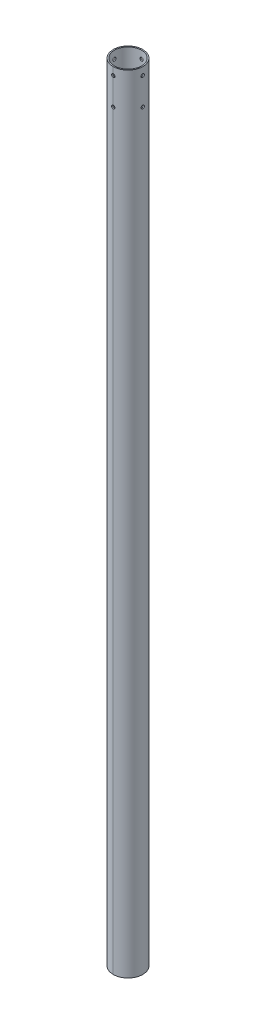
ISO-10303-21;
HEADER;
FILE_DESCRIPTION(('STEP AP214'),'2;1');
FILE_NAME('part.step','',(''),(''),'','','');
FILE_SCHEMA(('AUTOMOTIVE_DESIGN { 1 0 10303 214 1 1 1 1 }'));
ENDSEC;
DATA;
#1=APPLICATION_CONTEXT('core data for automotive mechanical design processes');
#2=APPLICATION_PROTOCOL_DEFINITION('international standard','automotive_design',2000,#1);
#3=PRODUCT_CONTEXT('',#1,'mechanical');
#4=PRODUCT('Part','Part','',(#3));
#5=PRODUCT_RELATED_PRODUCT_CATEGORY('part','',(#4));
#6=PRODUCT_DEFINITION_FORMATION('','',#4);
#7=PRODUCT_DEFINITION_CONTEXT('part definition',#1,'design');
#8=PRODUCT_DEFINITION('design','',#6,#7);
#9=PRODUCT_DEFINITION_SHAPE('','',#8);
#10=(LENGTH_UNIT() NAMED_UNIT(*) SI_UNIT(.MILLI.,.METRE.));
#11=(NAMED_UNIT(*) PLANE_ANGLE_UNIT() SI_UNIT($,.RADIAN.));
#12=(NAMED_UNIT(*) SI_UNIT($,.STERADIAN.) SOLID_ANGLE_UNIT());
#13=UNCERTAINTY_MEASURE_WITH_UNIT(LENGTH_MEASURE(1.E-05),#10,'distance_accuracy_value','');
#14=(GEOMETRIC_REPRESENTATION_CONTEXT(3) GLOBAL_UNCERTAINTY_ASSIGNED_CONTEXT((#13)) GLOBAL_UNIT_ASSIGNED_CONTEXT((#10,
#11,#12)) REPRESENTATION_CONTEXT('',''));
#15=CARTESIAN_POINT('',(0.,0.,0.));
#16=DIRECTION('',(0.,0.,1.));
#17=DIRECTION('',(1.,0.,0.));
#18=AXIS2_PLACEMENT_3D('',#15,#16,#17);
#19=CARTESIAN_POINT('',(0.,3115.53993403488,0.));
#20=DIRECTION('',(0.,1.,0.));
#21=DIRECTION('',(-1.,0.,0.));
#22=AXIS2_PLACEMENT_3D('',#19,#20,#21);
#23=CYLINDRICAL_SURFACE('',#22,38.0000000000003);
#24=CARTESIAN_POINT('',(-38.0000000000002,2905.75,0.));
#25=CARTESIAN_POINT('',(-37.9999969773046,2905.75001022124,-0.237927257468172));
#26=CARTESIAN_POINT('',(-37.9977417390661,2905.77004709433,-0.476007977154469));
#27=CARTESIAN_POINT('',(-37.9889620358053,2905.84966947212,-0.94555797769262));
#28=CARTESIAN_POINT('',(-37.9824329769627,2905.90929753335,-1.17701986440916));
#29=CARTESIAN_POINT('',(-37.9658419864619,2906.06633520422,-1.62646548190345));
#30=CARTESIAN_POINT('',(-37.9557822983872,2906.16372082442,-1.84445766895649));
#31=CARTESIAN_POINT('',(-37.9332522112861,2906.3934598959,-2.26095840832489));
#32=CARTESIAN_POINT('',(-37.9207822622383,2906.52580682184,-2.45947058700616));
#33=CARTESIAN_POINT('',(-37.8947643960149,2906.82234268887,-2.83230472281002));
#34=CARTESIAN_POINT('',(-37.8812123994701,2906.98665584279,-3.00652761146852));
#35=CARTESIAN_POINT('',(-37.8545911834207,2907.34219398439,-3.3249852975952));
#36=CARTESIAN_POINT('',(-37.841521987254,2907.53342027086,-3.46921864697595));
#37=CARTESIAN_POINT('',(-37.8173052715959,2907.93798810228,-3.72396272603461));
#38=CARTESIAN_POINT('',(-37.8061629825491,2908.15138739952,-3.83438227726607));
#39=CARTESIAN_POINT('',(-37.7871139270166,2908.59384473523,-4.01778214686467));
#40=CARTESIAN_POINT('',(-37.7792070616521,2908.82290229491,-4.09076360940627));
#41=CARTESIAN_POINT('',(-37.7675620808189,2909.28915462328,-4.19691833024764));
#42=CARTESIAN_POINT('',(-37.7638066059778,2909.52631119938,-4.23025740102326));
#43=CARTESIAN_POINT('',(-37.7608361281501,2910.002880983,-4.25669375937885));
#44=CARTESIAN_POINT('',(-37.7616209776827,2910.24229411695,-4.24979235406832));
#45=CARTESIAN_POINT('',(-37.7676265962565,2910.71543237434,-4.19608007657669));
#46=CARTESIAN_POINT('',(-37.7728271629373,2910.94917842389,-4.14945095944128));
#47=CARTESIAN_POINT('',(-37.7870467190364,2911.40550647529,-4.01789004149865));
#48=CARTESIAN_POINT('',(-37.7960657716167,2911.62808829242,-3.93295760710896));
#49=CARTESIAN_POINT('',(-37.8169291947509,2912.05633951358,-3.72700270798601));
#50=CARTESIAN_POINT('',(-37.8287798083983,2912.26197017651,-3.60590034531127));
#51=CARTESIAN_POINT('',(-37.8539660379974,2912.65005779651,-3.33110053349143));
#52=CARTESIAN_POINT('',(-37.8673017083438,2912.83251390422,-3.17740189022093));
#53=CARTESIAN_POINT('',(-37.8940454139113,2913.17012879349,-2.84076081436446));
#54=CARTESIAN_POINT('',(-37.9074534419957,2913.3251312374,-2.65766154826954));
#55=CARTESIAN_POINT('',(-37.932761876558,2913.60222464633,-2.26795927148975));
#56=CARTESIAN_POINT('',(-37.944662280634,2913.72431555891,-2.06135622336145));
#57=CARTESIAN_POINT('',(-37.9656199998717,2913.93211676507,-1.63039729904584));
#58=CARTESIAN_POINT('',(-37.9746766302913,2914.01781829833,-1.40603716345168));
#59=CARTESIAN_POINT('',(-37.9889197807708,2914.15028917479,-0.945987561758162));
#60=CARTESIAN_POINT('',(-37.9941064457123,2914.19705997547,-0.710298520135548));
#61=CARTESIAN_POINT('',(-38.0000065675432,2914.25014148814,-0.235634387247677));
#62=CARTESIAN_POINT('',(-38.0007438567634,2914.25666776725,0.00331631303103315));
#63=CARTESIAN_POINT('',(-37.9977262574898,2914.22964236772,0.478908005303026));
#64=CARTESIAN_POINT('',(-37.9939714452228,2914.19609136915,0.715549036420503));
#65=CARTESIAN_POINT('',(-37.9824065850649,2914.09004275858,1.17917563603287));
#66=CARTESIAN_POINT('',(-37.9746071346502,2914.017646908,1.40618476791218));
#67=CARTESIAN_POINT('',(-37.9558271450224,2913.83606876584,1.84483816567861));
#68=CARTESIAN_POINT('',(-37.9448465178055,2913.72688545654,2.05648200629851));
#69=CARTESIAN_POINT('',(-37.9208711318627,2913.47430293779,2.45936638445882));
#70=CARTESIAN_POINT('',(-37.9078681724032,2913.33076307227,2.65051824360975));
#71=CARTESIAN_POINT('',(-37.8813312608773,2913.01374248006,3.00609287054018));
#72=CARTESIAN_POINT('',(-37.8677972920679,2912.8402608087,3.17051479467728));
#73=CARTESIAN_POINT('',(-37.8416511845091,2912.46733645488,3.46871802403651));
#74=CARTESIAN_POINT('',(-37.8290434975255,2912.26777977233,3.60235721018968));
#75=CARTESIAN_POINT('',(-37.806247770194,2911.84892826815,3.83422230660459));
#76=CARTESIAN_POINT('',(-37.7960596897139,2911.62963377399,3.93244880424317));
#77=CARTESIAN_POINT('',(-37.7792857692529,2911.17800610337,4.09046579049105));
#78=CARTESIAN_POINT('',(-37.7726921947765,2910.94570211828,4.1503388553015));
#79=CARTESIAN_POINT('',(-37.7638307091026,2910.47425995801,4.230216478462));
#80=CARTESIAN_POINT('',(-37.7615626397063,2910.2351220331,4.25022249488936));
#81=CARTESIAN_POINT('',(-37.7616128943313,2909.75821330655,4.24977499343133));
#82=CARTESIAN_POINT('',(-37.7639059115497,2909.52044226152,4.22954472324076));
#83=CARTESIAN_POINT('',(-37.772765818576,2909.05170061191,4.14966908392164));
#84=CARTESIAN_POINT('',(-37.7793327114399,2908.82073001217,4.0900236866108));
#85=CARTESIAN_POINT('',(-37.7959930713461,2908.37215988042,3.93307626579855));
#86=CARTESIAN_POINT('',(-37.8060857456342,2908.15455735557,3.8357827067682));
#87=CARTESIAN_POINT('',(-37.8286619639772,2907.73873337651,3.60632311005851));
#88=CARTESIAN_POINT('',(-37.841145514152,2907.5405119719,3.47415698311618));
#89=CARTESIAN_POINT('',(-37.8671799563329,2907.16793370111,3.17786935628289));
#90=CARTESIAN_POINT('',(-37.8807361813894,2906.99370962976,3.01358132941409));
#91=CARTESIAN_POINT('',(-37.9073404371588,2906.67521166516,2.658053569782));
#92=CARTESIAN_POINT('',(-37.9203883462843,2906.53094490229,2.46680743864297));
#93=CARTESIAN_POINT('',(-37.9445489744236,2906.27609220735,2.0621312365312));
#94=CARTESIAN_POINT('',(-37.9556556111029,2906.16561134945,1.84863467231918));
#95=CARTESIAN_POINT('',(-37.974618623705,2905.98222047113,1.40612416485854));
#96=CARTESIAN_POINT('',(-37.9824786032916,2905.90926877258,1.17712775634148));
#97=CARTESIAN_POINT('',(-37.9921233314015,2905.82087451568,0.789069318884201));
#98=CARTESIAN_POINT('',(-37.9950630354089,2905.79433371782,0.632473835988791));
#99=CARTESIAN_POINT('',(-37.9990023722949,2905.75889310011,0.317274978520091));
#100=CARTESIAN_POINT('',(-38.0000020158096,2905.74999318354,0.158671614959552));
#101=CARTESIAN_POINT('',(-38.0000000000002,2905.75,0.));
#102=B_SPLINE_CURVE_WITH_KNOTS('',3,(#24,#25,#26,#27,#28,#29,#30,#31,#32,#33,#34,#35,#36,#37,
#38,#39,#40,#41,#42,#43,#44,#45,#46,#47,#48,#49,#50,#51,#52,#53,#54,#55,#56,#57,#58,#59,#60,#61,
#62,#63,#64,#65,#66,#67,#68,#69,#70,#71,#72,#73,#74,#75,#76,#77,#78,#79,#80,#81,#82,#83,#84,#85,
#86,#87,#88,#89,#90,#91,#92,#93,#94,#95,#96,#97,#98,#99,#100,#101),.UNSPECIFIED.,.T.,.F.,(4,2,2,
2,2,2,2,2,2,2,2,2,2,2,2,2,2,2,2,2,2,2,2,2,2,2,2,2,2,2,2,2,2,2,2,2,2,2,4),(0.,0.71320228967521,
1.4271724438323,2.1406897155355,2.85407390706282,3.57028759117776,4.28653585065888,
5.00469879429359,5.72283978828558,6.43796632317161,7.15306962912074,7.86491878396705,
8.57677971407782,9.29022489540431,10.00369621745,10.7211082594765,11.4385214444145,
12.1561072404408,12.8736661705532,13.5873781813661,14.3010780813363,15.0129173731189,
15.7247763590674,16.4396011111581,17.1544484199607,17.872532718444,18.5906051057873,
19.3071262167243,20.023621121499,20.7361517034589,21.4486827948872,22.1610537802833,
22.8734265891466,23.5895954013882,24.3059344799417,25.0244792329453,25.7422242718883,
26.2178552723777,26.6934836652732),.UNSPECIFIED.);
#103=CARTESIAN_POINT('',(-38.0000000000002,2905.75,0.));
#104=VERTEX_POINT('',#103);
#105=EDGE_CURVE('E144',#104,#104,#102,.T.);
#106=ORIENTED_EDGE('',*,*,#105,.T.);
#107=EDGE_LOOP('',(#106));
#108=FACE_BOUND('',#107,.T.);
#109=CARTESIAN_POINT('',(-38.0000000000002,2975.75,0.));
#110=CARTESIAN_POINT('',(-37.9999969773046,2975.75001022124,-0.237927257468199));
#111=CARTESIAN_POINT('',(-37.9977417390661,2975.77004709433,-0.476007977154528));
#112=CARTESIAN_POINT('',(-37.9889620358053,2975.84966947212,-0.945557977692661));
#113=CARTESIAN_POINT('',(-37.9824329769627,2975.90929753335,-1.17701986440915));
#114=CARTESIAN_POINT('',(-37.9658419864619,2976.06633520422,-1.62646548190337));
#115=CARTESIAN_POINT('',(-37.9557822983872,2976.16372082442,-1.8444576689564));
#116=CARTESIAN_POINT('',(-37.9332522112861,2976.3934598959,-2.26095840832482));
#117=CARTESIAN_POINT('',(-37.9207822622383,2976.52580682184,-2.45947058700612));
#118=CARTESIAN_POINT('',(-37.8947643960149,2976.82234268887,-2.8323047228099));
#119=CARTESIAN_POINT('',(-37.8812123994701,2976.98665584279,-3.0065276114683));
#120=CARTESIAN_POINT('',(-37.8545911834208,2977.34219398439,-3.32498529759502));
#121=CARTESIAN_POINT('',(-37.841521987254,2977.53342027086,-3.46921864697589));
#122=CARTESIAN_POINT('',(-37.8173052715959,2977.93798810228,-3.72396272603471));
#123=CARTESIAN_POINT('',(-37.8061629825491,2978.15138739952,-3.83438227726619));
#124=CARTESIAN_POINT('',(-37.7871139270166,2978.59384473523,-4.01778214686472));
#125=CARTESIAN_POINT('',(-37.7792070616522,2978.82290229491,-4.09076360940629));
#126=CARTESIAN_POINT('',(-37.7675620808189,2979.28915462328,-4.19691833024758));
#127=CARTESIAN_POINT('',(-37.7638066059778,2979.52631119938,-4.23025740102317));
#128=CARTESIAN_POINT('',(-37.7608361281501,2980.00288098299,-4.25669375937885));
#129=CARTESIAN_POINT('',(-37.7616209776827,2980.24229411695,-4.24979235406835));
#130=CARTESIAN_POINT('',(-37.7676265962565,2980.71543237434,-4.19608007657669));
#131=CARTESIAN_POINT('',(-37.7728271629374,2980.94917842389,-4.14945095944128));
#132=CARTESIAN_POINT('',(-37.7870467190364,2981.40550647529,-4.01789004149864));
#133=CARTESIAN_POINT('',(-37.7960657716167,2981.62808829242,-3.93295760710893));
#134=CARTESIAN_POINT('',(-37.8169291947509,2982.05633951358,-3.72700270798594));
#135=CARTESIAN_POINT('',(-37.8287798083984,2982.26197017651,-3.60590034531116));
#136=CARTESIAN_POINT('',(-37.8539660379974,2982.65005779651,-3.33110053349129));
#137=CARTESIAN_POINT('',(-37.8673017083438,2982.83251390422,-3.17740189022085));
#138=CARTESIAN_POINT('',(-37.8940454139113,2983.17012879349,-2.84076081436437));
#139=CARTESIAN_POINT('',(-37.9074534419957,2983.3251312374,-2.65766154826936));
#140=CARTESIAN_POINT('',(-37.932761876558,2983.60222464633,-2.26795927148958));
#141=CARTESIAN_POINT('',(-37.9446622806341,2983.72431555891,-2.0613562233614));
#142=CARTESIAN_POINT('',(-37.9656199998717,2983.93211676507,-1.63039729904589));
#143=CARTESIAN_POINT('',(-37.9746766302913,2984.01781829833,-1.40603716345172));
#144=CARTESIAN_POINT('',(-37.9889197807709,2984.15028917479,-0.945987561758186));
#145=CARTESIAN_POINT('',(-37.9941064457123,2984.19705997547,-0.710298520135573));
#146=CARTESIAN_POINT('',(-38.0000065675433,2984.25014148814,-0.235634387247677));
#147=CARTESIAN_POINT('',(-38.0007438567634,2984.25666776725,0.00331631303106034));
#148=CARTESIAN_POINT('',(-37.9977262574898,2984.22964236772,0.478908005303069));
#149=CARTESIAN_POINT('',(-37.9939714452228,2984.19609136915,0.715549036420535));
#150=CARTESIAN_POINT('',(-37.9824065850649,2984.09004275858,1.17917563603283));
#151=CARTESIAN_POINT('',(-37.9746071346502,2984.017646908,1.40618476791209));
#152=CARTESIAN_POINT('',(-37.9558271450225,2983.83606876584,1.84483816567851));
#153=CARTESIAN_POINT('',(-37.9448465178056,2983.72688545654,2.05648200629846));
#154=CARTESIAN_POINT('',(-37.9208711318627,2983.47430293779,2.45936638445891));
#155=CARTESIAN_POINT('',(-37.9078681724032,2983.33076307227,2.65051824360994));
#156=CARTESIAN_POINT('',(-37.8813312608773,2983.01374248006,3.00609287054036));
#157=CARTESIAN_POINT('',(-37.8677972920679,2982.8402608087,3.17051479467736));
#158=CARTESIAN_POINT('',(-37.8416511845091,2982.46733645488,3.46871802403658));
#159=CARTESIAN_POINT('',(-37.8290434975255,2982.26777977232,3.60235721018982));
#160=CARTESIAN_POINT('',(-37.806247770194,2981.84892826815,3.8342223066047));
#161=CARTESIAN_POINT('',(-37.7960596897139,2981.62963377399,3.93244880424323));
#162=CARTESIAN_POINT('',(-37.7792857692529,2981.17800610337,4.09046579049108));
#163=CARTESIAN_POINT('',(-37.7726921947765,2980.94570211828,4.15033885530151));
#164=CARTESIAN_POINT('',(-37.7638307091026,2980.47425995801,4.23021647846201));
#165=CARTESIAN_POINT('',(-37.7615626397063,2980.2351220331,4.25022249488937));
#166=CARTESIAN_POINT('',(-37.7616128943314,2979.75821330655,4.24977499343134));
#167=CARTESIAN_POINT('',(-37.7639059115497,2979.52044226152,4.22954472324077));
#168=CARTESIAN_POINT('',(-37.772765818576,2979.05170061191,4.14966908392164));
#169=CARTESIAN_POINT('',(-37.7793327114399,2978.82073001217,4.09002368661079));
#170=CARTESIAN_POINT('',(-37.7959930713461,2978.37215988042,3.93307626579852));
#171=CARTESIAN_POINT('',(-37.8060857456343,2978.15455735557,3.83578270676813));
#172=CARTESIAN_POINT('',(-37.8286619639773,2977.73873337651,3.60632311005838));
#173=CARTESIAN_POINT('',(-37.841145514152,2977.5405119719,3.47415698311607));
#174=CARTESIAN_POINT('',(-37.8671799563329,2977.16793370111,3.17786935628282));
#175=CARTESIAN_POINT('',(-37.8807361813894,2976.99370962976,3.01358132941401));
#176=CARTESIAN_POINT('',(-37.9073404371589,2976.67521166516,2.65805356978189));
#177=CARTESIAN_POINT('',(-37.9203883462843,2976.53094490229,2.46680743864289));
#178=CARTESIAN_POINT('',(-37.9445489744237,2976.27609220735,2.06213123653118));
#179=CARTESIAN_POINT('',(-37.955655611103,2976.16561134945,1.84863467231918));
#180=CARTESIAN_POINT('',(-37.974618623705,2975.98222047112,1.40612416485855));
#181=CARTESIAN_POINT('',(-37.9824786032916,2975.90926877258,1.17712775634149));
#182=CARTESIAN_POINT('',(-37.9921233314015,2975.82087451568,0.789069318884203));
#183=CARTESIAN_POINT('',(-37.9950630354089,2975.79433371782,0.632473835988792));
#184=CARTESIAN_POINT('',(-37.9990023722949,2975.75889310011,0.317274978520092));
#185=CARTESIAN_POINT('',(-38.0000020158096,2975.74999318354,0.158671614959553));
#186=CARTESIAN_POINT('',(-38.0000000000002,2975.75,0.));
#187=B_SPLINE_CURVE_WITH_KNOTS('',3,(#109,#110,#111,#112,#113,#114,#115,#116,#117,#118,#119,
#120,#121,#122,#123,#124,#125,#126,#127,#128,#129,#130,#131,#132,#133,#134,#135,#136,#137,#138,
#139,#140,#141,#142,#143,#144,#145,#146,#147,#148,#149,#150,#151,#152,#153,#154,#155,#156,#157,
#158,#159,#160,#161,#162,#163,#164,#165,#166,#167,#168,#169,#170,#171,#172,#173,#174,#175,#176,
#177,#178,#179,#180,#181,#182,#183,#184,#185,#186),.UNSPECIFIED.,.T.,.F.,(4,2,2,2,2,2,2,2,2,2,2,
2,2,2,2,2,2,2,2,2,2,2,2,2,2,2,2,2,2,2,2,2,2,2,2,2,2,2,4),(0.,0.713202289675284,1.4271724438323,
2.14068971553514,2.85407390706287,3.57028759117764,4.2865358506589,5.00469879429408,
5.72283978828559,6.43796632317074,7.15306962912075,7.86491878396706,8.57677971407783,
9.29022489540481,10.00369621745,10.7211082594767,11.4385214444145,12.1561072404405,
12.8736661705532,13.5873781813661,14.3010780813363,15.0129173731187,15.7247763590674,
16.4396011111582,17.1544484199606,17.8725327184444,18.5906051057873,19.3071262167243,
20.0236211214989,20.7361517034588,21.4486827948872,22.1610537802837,22.8734265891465,
23.5895954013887,24.3059344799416,25.0244792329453,25.7422242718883,26.2178552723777,
26.6934836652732),.UNSPECIFIED.);
#188=CARTESIAN_POINT('',(-38.0000000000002,2975.75,0.));
#189=VERTEX_POINT('',#188);
#190=EDGE_CURVE('E155',#189,#189,#187,.T.);
#191=ORIENTED_EDGE('',*,*,#190,.T.);
#192=EDGE_LOOP('',(#191));
#193=FACE_BOUND('',#192,.T.);
#194=CARTESIAN_POINT('',(2.63012745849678E-13,980.,0.));
#195=DIRECTION('',(0.,1.,0.));
#196=DIRECTION('',(-1.,0.,0.));
#197=AXIS2_PLACEMENT_3D('',#194,#195,#196);
#198=CIRCLE('',#197,38.0000000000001);
#199=CARTESIAN_POINT('',(3.83709384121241E-13,980.,-38.0000000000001));
#200=VERTEX_POINT('',#199);
#201=CARTESIAN_POINT('',(3.83709384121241E-13,980.,38.0000000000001));
#202=VERTEX_POINT('',#201);
#203=EDGE_CURVE('E194',#200,#202,#198,.T.);
#204=ORIENTED_EDGE('',*,*,#203,.T.);
#205=DIRECTION('',(0.,1.,0.));
#206=VECTOR('',#205,1.);
#207=CARTESIAN_POINT('',(0.,3115.53993403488,38.0000000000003));
#208=LINE('',#207,#206);
#209=CARTESIAN_POINT('',(0.,2905.75,38.0000000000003));
#210=VERTEX_POINT('',#209);
#211=EDGE_CURVE('E11',#202,#210,#208,.T.);
#212=ORIENTED_EDGE('',*,*,#211,.T.);
#213=CARTESIAN_POINT('',(-4.24999999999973,2910.,37.7615876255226));
#214=CARTESIAN_POINT('',(-4.24998977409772,2910.23792201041,37.7615907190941));
#215=CARTESIAN_POINT('',(-4.2299537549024,2910.47599749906,37.7638604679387));
#216=CARTESIAN_POINT('',(-4.15033507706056,2910.94553663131,37.7726920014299));
#217=CARTESIAN_POINT('',(-4.09070984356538,2911.17699287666,37.7792584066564));
#218=CARTESIAN_POINT('',(-3.93368044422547,2911.62642656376,37.7959303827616));
#219=CARTESIAN_POINT('',(-3.83630040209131,2911.84441250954,37.8060336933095));
#220=CARTESIAN_POINT('',(-3.60657446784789,2912.26090278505,37.8286383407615));
#221=CARTESIAN_POINT('',(-3.47423508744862,2912.45941073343,37.841139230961));
#222=CARTESIAN_POINT('',(-3.17770685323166,2912.83224962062,37.8671936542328));
#223=CARTESIAN_POINT('',(-3.01339209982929,2913.00648015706,37.8807512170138));
#224=CARTESIAN_POINT('',(-2.65784754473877,2913.32495261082,37.9073549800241));
#225=CARTESIAN_POINT('',(-2.46661646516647,2913.46919310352,37.9204011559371));
#226=CARTESIAN_POINT('',(-2.06204440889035,2913.72394467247,37.9445527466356));
#227=CARTESIAN_POINT('',(-1.84864650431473,2913.83436587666,37.9556529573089));
#228=CARTESIAN_POINT('',(-1.40619219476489,2914.01776918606,37.9746178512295));
#229=CARTESIAN_POINT('',(-1.17713626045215,2914.09075241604,37.9824826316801));
#230=CARTESIAN_POINT('',(-0.710889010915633,2914.19691080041,37.9940621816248));
#231=CARTESIAN_POINT('',(-0.473735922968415,2914.23025193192,37.9977942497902));
#232=CARTESIAN_POINT('',(0.00282702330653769,2914.25669362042,38.0007468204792));
#233=CARTESIAN_POINT('',(0.242236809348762,2914.24979546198,37.9999674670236));
#234=CARTESIAN_POINT('',(0.715389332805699,2914.19608834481,37.993999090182));
#235=CARTESIAN_POINT('',(0.949152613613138,2914.14945787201,37.9888297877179));
#236=CARTESIAN_POINT('',(1.40551442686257,2914.01788827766,37.9746847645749));
#237=CARTESIAN_POINT('',(1.62811278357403,2913.93294855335,37.9657089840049));
#238=CARTESIAN_POINT('',(2.05638413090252,2913.72697851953,37.9449258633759));
#239=CARTESIAN_POINT('',(2.26201920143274,2913.60587000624,37.9331123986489));
#240=CARTESIAN_POINT('',(2.65011303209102,2913.33105704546,37.907977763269));
#241=CARTESIAN_POINT('',(2.83257094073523,2913.17735140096,37.8946565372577));
#242=CARTESIAN_POINT('',(3.17017799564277,2912.84070533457,37.8679134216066));
#243=CARTESIAN_POINT('',(3.32517221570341,2912.65760951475,37.8544913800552));
#244=CARTESIAN_POINT('',(3.60225067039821,2912.26791707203,37.8291317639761));
#245=CARTESIAN_POINT('',(3.72433483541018,2912.06132039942,37.8171941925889));
#246=CARTESIAN_POINT('',(3.93213117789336,2911.63036325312,37.7961546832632));
#247=CARTESIAN_POINT('',(4.01783252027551,2911.40599751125,37.7870535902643));
#248=CARTESIAN_POINT('',(4.15030129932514,2910.94593571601,37.7727345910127));
#249=CARTESIAN_POINT('',(4.19707022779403,2910.71024009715,37.7675165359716));
#250=CARTESIAN_POINT('',(4.2501446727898,2910.23557282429,37.7615809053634));
#251=CARTESIAN_POINT('',(4.25666750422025,2909.99662575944,37.7608391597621));
#252=CARTESIAN_POINT('',(4.22963650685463,2909.52104216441,37.7638762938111));
#253=CARTESIAN_POINT('',(4.1960833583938,2909.28440559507,37.7676550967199));
#254=CARTESIAN_POINT('',(4.09003519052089,2908.82080159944,37.7792855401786));
#255=CARTESIAN_POINT('',(4.01764402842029,2908.59381012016,37.7871263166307));
#256=CARTESIAN_POINT('',(3.83608116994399,2908.15518995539,37.8059884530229));
#257=CARTESIAN_POINT('',(3.72690842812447,2907.94356170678,37.817009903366));
#258=CARTESIAN_POINT('',(3.47434153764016,2907.54068808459,37.8410498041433));
#259=CARTESIAN_POINT('',(3.33080405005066,2907.34953307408,37.8540765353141));
#260=CARTESIAN_POINT('',(3.0137863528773,2906.9939509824,37.8806326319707));
#261=CARTESIAN_POINT('',(2.84030521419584,2906.8295247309,37.8941620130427));
#262=CARTESIAN_POINT('',(2.46737899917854,2906.53131196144,37.9202725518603));
#263=CARTESIAN_POINT('',(2.26781982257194,2906.39766767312,37.9328491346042));
#264=CARTESIAN_POINT('',(1.84896195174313,2906.16579362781,37.9555696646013));
#265=CARTESIAN_POINT('',(1.62966358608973,2906.06756328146,37.9657136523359));
#266=CARTESIAN_POINT('',(1.17803820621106,2905.9095437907,37.9824055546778));
#267=CARTESIAN_POINT('',(0.945740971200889,2905.84967040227,37.9889613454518));
#268=CARTESIAN_POINT('',(0.474313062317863,2905.76978984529,37.9977706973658));
#269=CARTESIAN_POINT('',(0.23518263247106,2905.7497812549,38.0000244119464));
#270=CARTESIAN_POINT('',(-0.241730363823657,2905.75022116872,37.9999753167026));
#271=CARTESIAN_POINT('',(-0.479513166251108,2905.77044954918,37.9976972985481));
#272=CARTESIAN_POINT('',(-0.948278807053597,2905.8503255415,37.9888897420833));
#273=CARTESIAN_POINT('',(-1.17926164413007,2905.90997316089,37.9823602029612));
#274=CARTESIAN_POINT('',(-1.6278565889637,2906.06692972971,37.9657805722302));
#275=CARTESIAN_POINT('',(-1.84547163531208,2906.16423036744,37.955731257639));
#276=CARTESIAN_POINT('',(-2.26131770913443,2906.39370800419,37.9332289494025));
#277=CARTESIAN_POINT('',(-2.45954869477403,2906.52588507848,37.9207759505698));
#278=CARTESIAN_POINT('',(-2.83212663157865,2906.82218484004,37.8947776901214));
#279=CARTESIAN_POINT('',(-3.00634277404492,2906.98647154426,37.8812270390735));
#280=CARTESIAN_POINT('',(-3.32482535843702,2907.3419933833,37.8546053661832));
#281=CARTESIAN_POINT('',(-3.46908464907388,2907.53323493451,37.8415344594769));
#282=CARTESIAN_POINT('',(-3.72392919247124,2907.93790731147,37.8173087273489));
#283=CARTESIAN_POINT('',(-3.83440805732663,2908.15140545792,37.8061600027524));
#284=CARTESIAN_POINT('',(-4.01779477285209,2908.59391930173,37.7871129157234));
#285=CARTESIAN_POINT('',(-4.09074432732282,2908.82291745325,37.7792109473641));
#286=CARTESIAN_POINT('',(-4.17913261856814,2909.21097016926,37.7695119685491));
#287=CARTESIAN_POINT('',(-4.20567073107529,2909.36755776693,37.766554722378));
#288=CARTESIAN_POINT('',(-4.24110778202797,2909.68274083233,37.7625915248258));
#289=CARTESIAN_POINT('',(-4.25000681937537,2909.8413362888,37.761585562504));
#290=CARTESIAN_POINT('',(-4.24999999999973,2910.,37.7615876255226));
#291=B_SPLINE_CURVE_WITH_KNOTS('',3,(#213,#214,#215,#216,#217,#218,#219,#220,#221,#222,#223,
#224,#225,#226,#227,#228,#229,#230,#231,#232,#233,#234,#235,#236,#237,#238,#239,#240,#241,#242,
#243,#244,#245,#246,#247,#248,#249,#250,#251,#252,#253,#254,#255,#256,#257,#258,#259,#260,#261,
#262,#263,#264,#265,#266,#267,#268,#269,#270,#271,#272,#273,#274,#275,#276,#277,#278,#279,#280,
#281,#282,#283,#284,#285,#286,#287,#288,#289,#290),.UNSPECIFIED.,.T.,.F.,(4,2,2,2,2,2,2,2,2,2,2,
2,2,2,2,2,2,2,2,2,2,2,2,2,2,2,2,2,2,2,2,2,2,2,2,2,2,2,4),(0.,0.713186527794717,1.42714127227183,
2.14064057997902,2.85400708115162,3.57024139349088,4.2865097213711,5.00466528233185,
5.7227992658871,6.43791579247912,7.15300949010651,7.86490767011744,8.57681705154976,
9.29027699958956,10.0037631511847,10.7211542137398,11.4385467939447,12.1561528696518,
12.8737314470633,13.5874319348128,14.3011203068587,15.0129096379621,15.7247192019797,
16.4395511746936,17.1544053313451,17.8724990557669,18.5905808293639,19.3070800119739,
20.0235536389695,20.7361184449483,21.4486833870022,22.16109112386,22.8735003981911,
23.5896485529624,24.3059674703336,25.0245196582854,25.7422716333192,26.2178789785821,
26.6934836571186),.UNSPECIFIED.);
#292=CARTESIAN_POINT('',(0.,2914.25,38.0000000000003));
#293=VERTEX_POINT('',#292);
#294=EDGE_CURVE('E293',#210,#293,#291,.T.);
#295=ORIENTED_EDGE('',*,*,#294,.T.);
#296=CARTESIAN_POINT('',(0.,2975.75,38.0000000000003));
#297=VERTEX_POINT('',#296);
#298=EDGE_CURVE('E54',#293,#297,#208,.T.);
#299=ORIENTED_EDGE('',*,*,#298,.T.);
#300=CARTESIAN_POINT('',(-4.24999999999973,2980.,37.7615876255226));
#301=CARTESIAN_POINT('',(-4.24998977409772,2980.23792201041,37.7615907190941));
#302=CARTESIAN_POINT('',(-4.22995375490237,2980.47599749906,37.7638604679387));
#303=CARTESIAN_POINT('',(-4.15033507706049,2980.94553663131,37.7726920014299));
#304=CARTESIAN_POINT('',(-4.09070984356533,2981.17699287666,37.7792584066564));
#305=CARTESIAN_POINT('',(-3.93368044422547,2981.62642656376,37.7959303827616));
#306=CARTESIAN_POINT('',(-3.83630040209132,2981.84441250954,37.8060336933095));
#307=CARTESIAN_POINT('',(-3.60657446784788,2982.26090278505,37.8286383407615));
#308=CARTESIAN_POINT('',(-3.47423508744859,2982.45941073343,37.841139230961));
#309=CARTESIAN_POINT('',(-3.17770685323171,2982.83224962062,37.8671936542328));
#310=CARTESIAN_POINT('',(-3.01339209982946,2983.00648015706,37.8807512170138));
#311=CARTESIAN_POINT('',(-2.65784754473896,2983.32495261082,37.9073549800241));
#312=CARTESIAN_POINT('',(-2.46661646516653,2983.46919310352,37.9204011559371));
#313=CARTESIAN_POINT('',(-2.06204440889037,2983.72394467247,37.9445527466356));
#314=CARTESIAN_POINT('',(-1.84864650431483,2983.83436587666,37.9556529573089));
#315=CARTESIAN_POINT('',(-1.40619219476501,2984.01776918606,37.9746178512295));
#316=CARTESIAN_POINT('',(-1.1771362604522,2984.09075241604,37.9824826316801));
#317=CARTESIAN_POINT('',(-0.710889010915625,2984.19691080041,37.9940621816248));
#318=CARTESIAN_POINT('',(-0.473735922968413,2984.23025193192,37.9977942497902));
#319=CARTESIAN_POINT('',(0.00282702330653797,2984.25669362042,38.0007468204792));
#320=CARTESIAN_POINT('',(0.242236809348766,2984.24979546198,37.9999674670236));
#321=CARTESIAN_POINT('',(0.715389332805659,2984.19608834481,37.993999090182));
#322=CARTESIAN_POINT('',(0.949152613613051,2984.14945787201,37.9888297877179));
#323=CARTESIAN_POINT('',(1.4055144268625,2984.01788827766,37.9746847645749));
#324=CARTESIAN_POINT('',(1.62811278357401,2983.93294855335,37.9657089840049));
#325=CARTESIAN_POINT('',(2.05638413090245,2983.72697851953,37.9449258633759));
#326=CARTESIAN_POINT('',(2.26201920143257,2983.60587000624,37.9331123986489));
#327=CARTESIAN_POINT('',(2.65011303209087,2983.33105704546,37.907977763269));
#328=CARTESIAN_POINT('',(2.83257094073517,2983.17735140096,37.8946565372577));
#329=CARTESIAN_POINT('',(3.17017799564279,2982.84070533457,37.8679134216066));
#330=CARTESIAN_POINT('',(3.32517221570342,2982.65760951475,37.8544913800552));
#331=CARTESIAN_POINT('',(3.60225067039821,2982.26791707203,37.8291317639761));
#332=CARTESIAN_POINT('',(3.72433483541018,2982.06132039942,37.8171941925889));
#333=CARTESIAN_POINT('',(3.93213117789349,2981.63036325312,37.7961546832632));
#334=CARTESIAN_POINT('',(4.01783252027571,2981.40599751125,37.7870535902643));
#335=CARTESIAN_POINT('',(4.15030129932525,2980.94593571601,37.7727345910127));
#336=CARTESIAN_POINT('',(4.19707022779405,2980.71024009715,37.7675165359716));
#337=CARTESIAN_POINT('',(4.25014467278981,2980.23557282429,37.7615809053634));
#338=CARTESIAN_POINT('',(4.25666750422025,2979.99662575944,37.7608391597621));
#339=CARTESIAN_POINT('',(4.22963650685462,2979.52104216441,37.7638762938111));
#340=CARTESIAN_POINT('',(4.19608335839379,2979.28440559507,37.76765509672));
#341=CARTESIAN_POINT('',(4.09003519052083,2978.82080159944,37.7792855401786));
#342=CARTESIAN_POINT('',(4.01764402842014,2978.59381012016,37.7871263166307));
#343=CARTESIAN_POINT('',(3.83608116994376,2978.15518995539,37.8059884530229));
#344=CARTESIAN_POINT('',(3.72690842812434,2977.94356170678,37.817009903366));
#345=CARTESIAN_POINT('',(3.47434153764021,2977.54068808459,37.8410498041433));
#346=CARTESIAN_POINT('',(3.33080405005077,2977.34953307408,37.8540765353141));
#347=CARTESIAN_POINT('',(3.01378635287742,2976.9939509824,37.8806326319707));
#348=CARTESIAN_POINT('',(2.84030521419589,2976.8295247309,37.8941620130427));
#349=CARTESIAN_POINT('',(2.46737899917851,2976.53131196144,37.9202725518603));
#350=CARTESIAN_POINT('',(2.26781982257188,2976.39766767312,37.9328491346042));
#351=CARTESIAN_POINT('',(1.84896195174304,2976.16579362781,37.9555696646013));
#352=CARTESIAN_POINT('',(1.62966358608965,2976.06756328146,37.9657136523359));
#353=CARTESIAN_POINT('',(1.17803820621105,2975.9095437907,37.9824055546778));
#354=CARTESIAN_POINT('',(0.945740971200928,2975.84967040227,37.9889613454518));
#355=CARTESIAN_POINT('',(0.474313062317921,2975.76978984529,37.9977706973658));
#356=CARTESIAN_POINT('',(0.235182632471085,2975.7497812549,38.0000244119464));
#357=CARTESIAN_POINT('',(-0.241730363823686,2975.75022116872,37.9999753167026));
#358=CARTESIAN_POINT('',(-0.479513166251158,2975.77044954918,37.9976972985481));
#359=CARTESIAN_POINT('',(-0.94827880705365,2975.8503255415,37.9888897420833));
#360=CARTESIAN_POINT('',(-1.17926164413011,2975.90997316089,37.9823602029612));
#361=CARTESIAN_POINT('',(-1.62785658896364,2976.06692972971,37.9657805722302));
#362=CARTESIAN_POINT('',(-1.84547163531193,2976.16423036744,37.955731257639));
#363=CARTESIAN_POINT('',(-2.2613177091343,2976.39370800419,37.9332289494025));
#364=CARTESIAN_POINT('',(-2.45954869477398,2976.52588507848,37.9207759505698));
#365=CARTESIAN_POINT('',(-2.83212663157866,2976.82218484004,37.8947776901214));
#366=CARTESIAN_POINT('',(-3.00634277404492,2976.98647154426,37.8812270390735));
#367=CARTESIAN_POINT('',(-3.32482535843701,2977.3419933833,37.8546053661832));
#368=CARTESIAN_POINT('',(-3.46908464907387,2977.53323493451,37.8415344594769));
#369=CARTESIAN_POINT('',(-3.72392919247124,2977.93790731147,37.8173087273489));
#370=CARTESIAN_POINT('',(-3.83440805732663,2978.15140545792,37.8061600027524));
#371=CARTESIAN_POINT('',(-4.01779477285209,2978.59391930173,37.7871129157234));
#372=CARTESIAN_POINT('',(-4.09074432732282,2978.82291745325,37.7792109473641));
#373=CARTESIAN_POINT('',(-4.17913261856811,2979.21097016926,37.7695119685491));
#374=CARTESIAN_POINT('',(-4.20567073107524,2979.36755776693,37.766554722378));
#375=CARTESIAN_POINT('',(-4.24110778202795,2979.68274083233,37.7625915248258));
#376=CARTESIAN_POINT('',(-4.25000681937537,2979.8413362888,37.761585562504));
#377=CARTESIAN_POINT('',(-4.24999999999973,2980.,37.7615876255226));
#378=B_SPLINE_CURVE_WITH_KNOTS('',3,(#300,#301,#302,#303,#304,#305,#306,#307,#308,#309,#310,
#311,#312,#313,#314,#315,#316,#317,#318,#319,#320,#321,#322,#323,#324,#325,#326,#327,#328,#329,
#330,#331,#332,#333,#334,#335,#336,#337,#338,#339,#340,#341,#342,#343,#344,#345,#346,#347,#348,
#349,#350,#351,#352,#353,#354,#355,#356,#357,#358,#359,#360,#361,#362,#363,#364,#365,#366,#367,
#368,#369,#370,#371,#372,#373,#374,#375,#376,#377),.UNSPECIFIED.,.T.,.F.,(4,2,2,2,2,2,2,2,2,2,2,
2,2,2,2,2,2,2,2,2,2,2,2,2,2,2,2,2,2,2,2,2,2,2,2,2,2,2,4),(0.,0.713186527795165,1.42714127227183,
2.14064057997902,2.85400708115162,3.57024139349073,4.28650972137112,5.00466528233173,
5.72279926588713,6.43791579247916,7.15300949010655,7.86490767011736,8.57681705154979,
9.29027699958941,10.0037631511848,10.7211542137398,11.4385467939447,12.1561528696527,
12.8737314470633,13.5874319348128,14.3011203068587,15.0129096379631,15.7247192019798,
16.4395511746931,17.1544053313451,17.8724990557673,18.590580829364,19.3070800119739,
20.0235536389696,20.7361184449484,21.4486833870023,22.1610911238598,22.8735003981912,
23.5896485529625,24.3059674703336,25.0245196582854,25.7422716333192,26.2178789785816,
26.6934836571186),.UNSPECIFIED.);
#379=CARTESIAN_POINT('',(0.,2984.25,38.0000000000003));
#380=VERTEX_POINT('',#379);
#381=EDGE_CURVE('E319',#297,#380,#378,.T.);
#382=ORIENTED_EDGE('',*,*,#381,.T.);
#383=CARTESIAN_POINT('',(3.83709384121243E-13,3000.,38.0000000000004));
#384=VERTEX_POINT('',#383);
#385=EDGE_CURVE('E48',#380,#384,#208,.T.);
#386=ORIENTED_EDGE('',*,*,#385,.T.);
#387=CARTESIAN_POINT('',(0.,3000.,0.));
#388=DIRECTION('',(0.,1.,0.));
#389=DIRECTION('',(-1.,0.,0.));
#390=AXIS2_PLACEMENT_3D('',#387,#388,#389);
#391=CIRCLE('',#390,38.0000000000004);
#392=CARTESIAN_POINT('',(3.83709384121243E-13,3000.,-38.0000000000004));
#393=VERTEX_POINT('',#392);
#394=EDGE_CURVE('E102',#393,#384,#391,.T.);
#395=ORIENTED_EDGE('',*,*,#394,.F.);
#396=DIRECTION('',(0.,-1.,0.));
#397=VECTOR('',#396,1.);
#398=CARTESIAN_POINT('',(0.,3115.53993403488,-38.0000000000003));
#399=LINE('',#398,#397);
#400=CARTESIAN_POINT('',(0.,2984.25,-38.0000000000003));
#401=VERTEX_POINT('',#400);
#402=EDGE_CURVE('E96',#393,#401,#399,.T.);
#403=ORIENTED_EDGE('',*,*,#402,.T.);
#404=CARTESIAN_POINT('',(4.24999999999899,2980.,-37.7615876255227));
#405=CARTESIAN_POINT('',(4.24998977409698,2980.23792201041,-37.7615907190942));
#406=CARTESIAN_POINT('',(4.22995375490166,2980.47599749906,-37.7638604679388));
#407=CARTESIAN_POINT('',(4.15033507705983,2980.94553663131,-37.77269200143));
#408=CARTESIAN_POINT('',(4.09070984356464,2981.17699287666,-37.7792584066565));
#409=CARTESIAN_POINT('',(3.93368044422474,2981.62642656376,-37.7959303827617));
#410=CARTESIAN_POINT('',(3.83630040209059,2981.84441250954,-37.8060336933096));
#411=CARTESIAN_POINT('',(3.60657446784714,2982.26090278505,-37.8286383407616));
#412=CARTESIAN_POINT('',(3.47423508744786,2982.45941073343,-37.8411392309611));
#413=CARTESIAN_POINT('',(3.17770685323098,2982.83224962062,-37.8671936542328));
#414=CARTESIAN_POINT('',(3.01339209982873,2983.00648015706,-37.8807512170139));
#415=CARTESIAN_POINT('',(2.65784754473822,2983.32495261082,-37.9073549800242));
#416=CARTESIAN_POINT('',(2.4666164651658,2983.46919310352,-37.9204011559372));
#417=CARTESIAN_POINT('',(2.06204440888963,2983.72394467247,-37.9445527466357));
#418=CARTESIAN_POINT('',(1.8486465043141,2983.83436587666,-37.9556529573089));
#419=CARTESIAN_POINT('',(1.40619219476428,2984.01776918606,-37.9746178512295));
#420=CARTESIAN_POINT('',(1.17713626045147,2984.09075241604,-37.9824826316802));
#421=CARTESIAN_POINT('',(0.710889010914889,2984.19691080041,-37.9940621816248));
#422=CARTESIAN_POINT('',(0.473735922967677,2984.23025193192,-37.9977942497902));
#423=CARTESIAN_POINT('',(-0.00282702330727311,2984.25669362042,-38.0007468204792));
#424=CARTESIAN_POINT('',(-0.242236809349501,2984.24979546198,-37.9999674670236));
#425=CARTESIAN_POINT('',(-0.715389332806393,2984.19608834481,-37.993999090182));
#426=CARTESIAN_POINT('',(-0.949152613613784,2984.14945787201,-37.9888297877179));
#427=CARTESIAN_POINT('',(-1.40551442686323,2984.01788827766,-37.9746847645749));
#428=CARTESIAN_POINT('',(-1.62811278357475,2983.93294855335,-37.9657089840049));
#429=CARTESIAN_POINT('',(-2.05638413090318,2983.72697851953,-37.9449258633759));
#430=CARTESIAN_POINT('',(-2.2620192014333,2983.60587000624,-37.9331123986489));
#431=CARTESIAN_POINT('',(-2.65011303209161,2983.33105704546,-37.9079777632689));
#432=CARTESIAN_POINT('',(-2.83257094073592,2983.17735140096,-37.8946565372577));
#433=CARTESIAN_POINT('',(-3.17017799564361,2982.84070533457,-37.8679134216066));
#434=CARTESIAN_POINT('',(-3.32517221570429,2982.65760951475,-37.8544913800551));
#435=CARTESIAN_POINT('',(-3.60225067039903,2982.26791707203,-37.829131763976));
#436=CARTESIAN_POINT('',(-3.72433483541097,2982.06132039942,-37.8171941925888));
#437=CARTESIAN_POINT('',(-3.93213117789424,2981.63036325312,-37.7961546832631));
#438=CARTESIAN_POINT('',(-4.01783252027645,2981.40599751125,-37.7870535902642));
#439=CARTESIAN_POINT('',(-4.15030129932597,2980.94593571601,-37.7727345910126));
#440=CARTESIAN_POINT('',(-4.19707022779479,2980.71024009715,-37.7675165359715));
#441=CARTESIAN_POINT('',(-4.25014467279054,2980.23557282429,-37.7615809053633));
#442=CARTESIAN_POINT('',(-4.25666750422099,2979.99662575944,-37.760839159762));
#443=CARTESIAN_POINT('',(-4.22963650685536,2979.52104216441,-37.763876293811));
#444=CARTESIAN_POINT('',(-4.19608335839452,2979.28440559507,-37.7676550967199));
#445=CARTESIAN_POINT('',(-4.09003519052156,2978.82080159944,-37.7792855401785));
#446=CARTESIAN_POINT('',(-4.01764402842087,2978.59381012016,-37.7871263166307));
#447=CARTESIAN_POINT('',(-3.83608116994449,2978.15518995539,-37.8059884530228));
#448=CARTESIAN_POINT('',(-3.72690842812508,2977.94356170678,-37.8170099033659));
#449=CARTESIAN_POINT('',(-3.47434153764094,2977.54068808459,-37.8410498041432));
#450=CARTESIAN_POINT('',(-3.3308040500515,2977.34953307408,-37.854076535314));
#451=CARTESIAN_POINT('',(-3.01378635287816,2976.9939509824,-37.8806326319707));
#452=CARTESIAN_POINT('',(-2.84030521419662,2976.8295247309,-37.8941620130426));
#453=CARTESIAN_POINT('',(-2.46737899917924,2976.53131196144,-37.9202725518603));
#454=CARTESIAN_POINT('',(-2.26781982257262,2976.39766767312,-37.9328491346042));
#455=CARTESIAN_POINT('',(-1.84896195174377,2976.16579362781,-37.9555696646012));
#456=CARTESIAN_POINT('',(-1.62966358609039,2976.06756328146,-37.9657136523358));
#457=CARTESIAN_POINT('',(-1.17803820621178,2975.9095437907,-37.9824055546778));
#458=CARTESIAN_POINT('',(-0.945740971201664,2975.84967040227,-37.9889613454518));
#459=CARTESIAN_POINT('',(-0.474313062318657,2975.76978984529,-37.9977706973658));
#460=CARTESIAN_POINT('',(-0.235182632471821,2975.7497812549,-38.0000244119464));
#461=CARTESIAN_POINT('',(0.24173036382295,2975.75022116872,-37.9999753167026));
#462=CARTESIAN_POINT('',(0.479513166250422,2975.77044954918,-37.9976972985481));
#463=CARTESIAN_POINT('',(0.948278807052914,2975.8503255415,-37.9888897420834));
#464=CARTESIAN_POINT('',(1.17926164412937,2975.90997316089,-37.9823602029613));
#465=CARTESIAN_POINT('',(1.6278565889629,2976.06692972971,-37.9657805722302));
#466=CARTESIAN_POINT('',(1.8454716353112,2976.16423036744,-37.955731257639));
#467=CARTESIAN_POINT('',(2.26131770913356,2976.39370800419,-37.9332289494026));
#468=CARTESIAN_POINT('',(2.45954869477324,2976.52588507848,-37.9207759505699));
#469=CARTESIAN_POINT('',(2.83212663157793,2976.82218484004,-37.8947776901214));
#470=CARTESIAN_POINT('',(3.00634277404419,2976.98647154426,-37.8812270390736));
#471=CARTESIAN_POINT('',(3.32482535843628,2977.3419933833,-37.8546053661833));
#472=CARTESIAN_POINT('',(3.46908464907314,2977.53323493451,-37.8415344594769));
#473=CARTESIAN_POINT('',(3.72392919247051,2977.93790731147,-37.817308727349));
#474=CARTESIAN_POINT('',(3.83440805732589,2978.15140545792,-37.8061600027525));
#475=CARTESIAN_POINT('',(4.01779477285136,2978.59391930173,-37.7871129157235));
#476=CARTESIAN_POINT('',(4.09074432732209,2978.82291745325,-37.7792109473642));
#477=CARTESIAN_POINT('',(4.17913261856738,2979.21097016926,-37.7695119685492));
#478=CARTESIAN_POINT('',(4.2056707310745,2979.36755776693,-37.7665547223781));
#479=CARTESIAN_POINT('',(4.24110778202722,2979.68274083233,-37.7625915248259));
#480=CARTESIAN_POINT('',(4.25000681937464,2979.8413362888,-37.7615855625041));
#481=CARTESIAN_POINT('',(4.24999999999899,2980.,-37.7615876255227));
#482=B_SPLINE_CURVE_WITH_KNOTS('',3,(#404,#405,#406,#407,#408,#409,#410,#411,#412,#413,#414,
#415,#416,#417,#418,#419,#420,#421,#422,#423,#424,#425,#426,#427,#428,#429,#430,#431,#432,#433,
#434,#435,#436,#437,#438,#439,#440,#441,#442,#443,#444,#445,#446,#447,#448,#449,#450,#451,#452,
#453,#454,#455,#456,#457,#458,#459,#460,#461,#462,#463,#464,#465,#466,#467,#468,#469,#470,#471,
#472,#473,#474,#475,#476,#477,#478,#479,#480,#481),.UNSPECIFIED.,.T.,.F.,(4,2,2,2,2,2,2,2,2,2,2,
2,2,2,2,2,2,2,2,2,2,2,2,2,2,2,2,2,2,2,2,2,2,2,2,2,2,2,4),(0.,0.713186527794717,1.42714127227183,
2.14064057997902,2.85400708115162,3.57024139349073,4.28650972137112,5.00466528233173,
5.72279926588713,6.43791579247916,7.15300949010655,7.86490767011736,8.57681705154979,
9.29027699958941,10.0037631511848,10.7211542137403,11.4385467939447,12.1561528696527,
12.8737314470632,13.5874319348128,14.3011203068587,15.012909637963,15.7247192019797,
16.4395511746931,17.1544053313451,17.8724990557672,18.5905808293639,19.3070800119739,
20.0235536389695,20.7361184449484,21.4486833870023,22.1610911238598,22.8735003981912,
23.5896485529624,24.3059674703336,25.0245196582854,25.7422716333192,26.2178789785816,
26.6934836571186),.UNSPECIFIED.);
#483=CARTESIAN_POINT('',(0.,2975.75,-38.0000000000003));
#484=VERTEX_POINT('',#483);
#485=EDGE_CURVE('E100',#401,#484,#482,.T.);
#486=ORIENTED_EDGE('',*,*,#485,.T.);
#487=CARTESIAN_POINT('',(0.,2914.25,-38.0000000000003));
#488=VERTEX_POINT('',#487);
#489=EDGE_CURVE('E104',#484,#488,#399,.T.);
#490=ORIENTED_EDGE('',*,*,#489,.T.);
#491=CARTESIAN_POINT('',(4.24999999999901,2910.,-37.7615876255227));
#492=CARTESIAN_POINT('',(4.249989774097,2910.23792201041,-37.7615907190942));
#493=CARTESIAN_POINT('',(4.22995375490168,2910.47599749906,-37.7638604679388));
#494=CARTESIAN_POINT('',(4.15033507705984,2910.94553663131,-37.77269200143));
#495=CARTESIAN_POINT('',(4.09070984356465,2911.17699287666,-37.7792584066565));
#496=CARTESIAN_POINT('',(3.93368044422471,2911.62642656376,-37.7959303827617));
#497=CARTESIAN_POINT('',(3.83630040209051,2911.84441250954,-37.8060336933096));
#498=CARTESIAN_POINT('',(3.60657446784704,2912.26090278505,-37.8286383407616));
#499=CARTESIAN_POINT('',(3.47423508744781,2912.45941073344,-37.8411392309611));
#500=CARTESIAN_POINT('',(3.17770685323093,2912.83224962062,-37.8671936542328));
#501=CARTESIAN_POINT('',(3.01339209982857,2913.00648015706,-37.8807512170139));
#502=CARTESIAN_POINT('',(2.65784754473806,2913.32495261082,-37.9073549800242));
#503=CARTESIAN_POINT('',(2.46661646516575,2913.46919310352,-37.9204011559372));
#504=CARTESIAN_POINT('',(2.06204440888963,2913.72394467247,-37.9445527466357));
#505=CARTESIAN_POINT('',(1.84864650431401,2913.83436587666,-37.9556529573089));
#506=CARTESIAN_POINT('',(1.40619219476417,2914.01776918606,-37.9746178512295));
#507=CARTESIAN_POINT('',(1.17713626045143,2914.09075241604,-37.9824826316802));
#508=CARTESIAN_POINT('',(0.710889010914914,2914.19691080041,-37.9940621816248));
#509=CARTESIAN_POINT('',(0.473735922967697,2914.23025193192,-37.9977942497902));
#510=CARTESIAN_POINT('',(-0.00282702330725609,2914.25669362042,-38.0007468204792));
#511=CARTESIAN_POINT('',(-0.242236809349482,2914.24979546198,-37.9999674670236));
#512=CARTESIAN_POINT('',(-0.715389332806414,2914.19608834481,-37.993999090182));
#513=CARTESIAN_POINT('',(-0.949152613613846,2914.14945787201,-37.9888297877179));
#514=CARTESIAN_POINT('',(-1.4055144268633,2914.01788827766,-37.9746847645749));
#515=CARTESIAN_POINT('',(-1.62811278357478,2913.93294855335,-37.9657089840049));
#516=CARTESIAN_POINT('',(-2.05638413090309,2913.72697851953,-37.9449258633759));
#517=CARTESIAN_POINT('',(-2.26201920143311,2913.60587000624,-37.9331123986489));
#518=CARTESIAN_POINT('',(-2.65011303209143,2913.33105704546,-37.9079777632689));
#519=CARTESIAN_POINT('',(-2.83257094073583,2913.17735140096,-37.8946565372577));
#520=CARTESIAN_POINT('',(-3.17017799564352,2912.84070533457,-37.8679134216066));
#521=CARTESIAN_POINT('',(-3.32517221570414,2912.65760951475,-37.8544913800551));
#522=CARTESIAN_POINT('',(-3.60225067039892,2912.26791707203,-37.829131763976));
#523=CARTESIAN_POINT('',(-3.72433483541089,2912.06132039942,-37.8171941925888));
#524=CARTESIAN_POINT('',(-3.93213117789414,2911.63036325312,-37.7961546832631));
#525=CARTESIAN_POINT('',(-4.01783252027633,2911.40599751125,-37.7870535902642));
#526=CARTESIAN_POINT('',(-4.15030129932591,2910.94593571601,-37.7727345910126));
#527=CARTESIAN_POINT('',(-4.19707022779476,2910.71024009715,-37.7675165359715));
#528=CARTESIAN_POINT('',(-4.25014467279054,2910.23557282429,-37.7615809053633));
#529=CARTESIAN_POINT('',(-4.25666750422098,2909.99662575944,-37.760839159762));
#530=CARTESIAN_POINT('',(-4.2296365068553,2909.52104216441,-37.763876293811));
#531=CARTESIAN_POINT('',(-4.19608335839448,2909.28440559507,-37.7676550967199));
#532=CARTESIAN_POINT('',(-4.09003519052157,2908.82080159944,-37.7792855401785));
#533=CARTESIAN_POINT('',(-4.01764402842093,2908.59381012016,-37.7871263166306));
#534=CARTESIAN_POINT('',(-3.83608116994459,2908.15518995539,-37.8059884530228));
#535=CARTESIAN_POINT('',(-3.72690842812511,2907.94356170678,-37.8170099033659));
#536=CARTESIAN_POINT('',(-3.47434153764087,2907.54068808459,-37.8410498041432));
#537=CARTESIAN_POINT('',(-3.33080405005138,2907.34953307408,-37.854076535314));
#538=CARTESIAN_POINT('',(-3.01378635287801,2906.9939509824,-37.8806326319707));
#539=CARTESIAN_POINT('',(-2.84030521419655,2906.8295247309,-37.8941620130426));
#540=CARTESIAN_POINT('',(-2.46737899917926,2906.53131196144,-37.9202725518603));
#541=CARTESIAN_POINT('',(-2.26781982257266,2906.39766767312,-37.9328491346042));
#542=CARTESIAN_POINT('',(-1.84896195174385,2906.16579362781,-37.9555696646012));
#543=CARTESIAN_POINT('',(-1.62966358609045,2906.06756328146,-37.9657136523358));
#544=CARTESIAN_POINT('',(-1.17803820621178,2905.9095437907,-37.9824055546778));
#545=CARTESIAN_POINT('',(-0.945740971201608,2905.84967040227,-37.9889613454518));
#546=CARTESIAN_POINT('',(-0.474313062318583,2905.76978984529,-37.9977706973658));
#547=CARTESIAN_POINT('',(-0.235182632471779,2905.7497812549,-38.0000244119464));
#548=CARTESIAN_POINT('',(0.241730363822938,2905.75022116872,-37.9999753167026));
#549=CARTESIAN_POINT('',(0.479513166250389,2905.77044954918,-37.9976972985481));
#550=CARTESIAN_POINT('',(0.948278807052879,2905.8503255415,-37.9888897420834));
#551=CARTESIAN_POINT('',(1.17926164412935,2905.90997316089,-37.9823602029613));
#552=CARTESIAN_POINT('',(1.62785658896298,2906.06692972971,-37.9657805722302));
#553=CARTESIAN_POINT('',(1.84547163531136,2906.16423036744,-37.955731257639));
#554=CARTESIAN_POINT('',(2.26131770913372,2906.39370800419,-37.9332289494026));
#555=CARTESIAN_POINT('',(2.45954869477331,2906.52588507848,-37.9207759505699));
#556=CARTESIAN_POINT('',(2.83212663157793,2906.82218484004,-37.8947776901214));
#557=CARTESIAN_POINT('',(3.0063427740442,2906.98647154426,-37.8812270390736));
#558=CARTESIAN_POINT('',(3.3248253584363,2907.3419933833,-37.8546053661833));
#559=CARTESIAN_POINT('',(3.46908464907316,2907.53323493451,-37.8415344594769));
#560=CARTESIAN_POINT('',(3.72392919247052,2907.93790731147,-37.8173087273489));
#561=CARTESIAN_POINT('',(3.83440805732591,2908.15140545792,-37.8061600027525));
#562=CARTESIAN_POINT('',(4.01779477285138,2908.59391930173,-37.7871129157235));
#563=CARTESIAN_POINT('',(4.0907443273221,2908.82291745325,-37.7792109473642));
#564=CARTESIAN_POINT('',(4.17913261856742,2909.21097016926,-37.7695119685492));
#565=CARTESIAN_POINT('',(4.20567073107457,2909.36755776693,-37.766554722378));
#566=CARTESIAN_POINT('',(4.24110778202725,2909.68274083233,-37.7625915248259));
#567=CARTESIAN_POINT('',(4.25000681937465,2909.8413362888,-37.7615855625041));
#568=CARTESIAN_POINT('',(4.24999999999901,2910.,-37.7615876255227));
#569=B_SPLINE_CURVE_WITH_KNOTS('',3,(#491,#492,#493,#494,#495,#496,#497,#498,#499,#500,#501,
#502,#503,#504,#505,#506,#507,#508,#509,#510,#511,#512,#513,#514,#515,#516,#517,#518,#519,#520,
#521,#522,#523,#524,#525,#526,#527,#528,#529,#530,#531,#532,#533,#534,#535,#536,#537,#538,#539,
#540,#541,#542,#543,#544,#545,#546,#547,#548,#549,#550,#551,#552,#553,#554,#555,#556,#557,#558,
#559,#560,#561,#562,#563,#564,#565,#566,#567,#568),.UNSPECIFIED.,.T.,.F.,(4,2,2,2,2,2,2,2,2,2,2,
2,2,2,2,2,2,2,2,2,2,2,2,2,2,2,2,2,2,2,2,2,2,2,2,2,2,2,4),(0.,0.713186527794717,1.42714127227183,
2.1406405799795,2.85400708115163,3.57024139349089,4.2865097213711,5.00466528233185,
5.72279926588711,6.43791579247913,7.15300949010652,7.86490767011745,8.57681705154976,
9.29027699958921,10.0037631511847,10.7211542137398,11.4385467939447,12.1561528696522,
12.8737314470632,13.5874319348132,14.3011203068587,15.0129096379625,15.7247192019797,
16.4395511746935,17.1544053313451,17.8724990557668,18.5905808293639,19.3070800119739,
20.0235536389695,20.7361184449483,21.4486833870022,22.1610911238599,22.8735003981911,
23.5896485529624,24.3059674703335,25.0245196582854,25.7422716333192,26.217878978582,
26.6934836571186),.UNSPECIFIED.);
#570=CARTESIAN_POINT('',(0.,2905.75,-38.0000000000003));
#571=VERTEX_POINT('',#570);
#572=EDGE_CURVE('E218',#488,#571,#569,.T.);
#573=ORIENTED_EDGE('',*,*,#572,.T.);
#574=EDGE_CURVE('E105',#571,#200,#399,.T.);
#575=ORIENTED_EDGE('',*,*,#574,.T.);
#576=EDGE_LOOP('',(#204,#212,#295,#299,#382,#386,#395,#403,#486,#490,#573,#575));
#577=FACE_BOUND('',#576,.T.);
#578=ADVANCED_FACE('F44',(#108,#193,#577),#23,.T.);
#579=CARTESIAN_POINT('',(38.0000000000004,3000.,0.));
#580=DIRECTION('',(0.,-1.,0.));
#581=DIRECTION('',(1.,0.,0.));
#582=AXIS2_PLACEMENT_3D('',#579,#580,#581);
#583=PLANE('',#582);
#584=CARTESIAN_POINT('',(0.,3000.,0.));
#585=DIRECTION('',(0.,1.,0.));
#586=DIRECTION('',(-1.,0.,0.));
#587=AXIS2_PLACEMENT_3D('',#584,#585,#586);
#588=CIRCLE('',#587,35.0000000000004);
#589=CARTESIAN_POINT('',(-35.0000000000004,3000.,0.));
#590=VERTEX_POINT('',#589);
#591=EDGE_CURVE('E200',#590,#590,#588,.T.);
#592=ORIENTED_EDGE('',*,*,#591,.F.);
#593=EDGE_LOOP('',(#592));
#594=FACE_BOUND('',#593,.T.);
#595=ORIENTED_EDGE('',*,*,#394,.T.);
#596=EDGE_CURVE('E208',#384,#393,#391,.T.);
#597=ORIENTED_EDGE('',*,*,#596,.T.);
#598=EDGE_LOOP('',(#595,#597));
#599=FACE_BOUND('',#598,.T.);
#600=ADVANCED_FACE('F46',(#594,#599),#583,.F.);
#601=ORIENTED_EDGE('',*,*,#211,.F.);
#602=EDGE_CURVE('E199',#202,#200,#198,.T.);
#603=ORIENTED_EDGE('',*,*,#602,.T.);
#604=ORIENTED_EDGE('',*,*,#574,.F.);
#605=EDGE_CURVE('E118',#571,#488,#569,.T.);
#606=ORIENTED_EDGE('',*,*,#605,.T.);
#607=ORIENTED_EDGE('',*,*,#489,.F.);
#608=EDGE_CURVE('E107',#484,#401,#482,.T.);
#609=ORIENTED_EDGE('',*,*,#608,.T.);
#610=ORIENTED_EDGE('',*,*,#402,.F.);
#611=ORIENTED_EDGE('',*,*,#596,.F.);
#612=ORIENTED_EDGE('',*,*,#385,.F.);
#613=EDGE_CURVE('E284',#380,#297,#378,.T.);
#614=ORIENTED_EDGE('',*,*,#613,.T.);
#615=ORIENTED_EDGE('',*,*,#298,.F.);
#616=EDGE_CURVE('E294',#293,#210,#291,.T.);
#617=ORIENTED_EDGE('',*,*,#616,.T.);
#618=EDGE_LOOP('',(#601,#603,#604,#606,#607,#609,#610,#611,#612,#614,#615,#617));
#619=FACE_BOUND('',#618,.T.);
#620=CARTESIAN_POINT('',(37.7615876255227,2980.,4.2499999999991));
#621=CARTESIAN_POINT('',(37.7615907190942,2980.23792201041,4.2499897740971));
#622=CARTESIAN_POINT('',(37.7638604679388,2980.47599749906,4.22995375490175));
#623=CARTESIAN_POINT('',(37.77269200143,2980.94553663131,4.15033507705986));
#624=CARTESIAN_POINT('',(37.7792584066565,2981.17699287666,4.0907098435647));
#625=CARTESIAN_POINT('',(37.7959303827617,2981.62642656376,3.93368044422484));
#626=CARTESIAN_POINT('',(37.8060336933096,2981.84441250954,3.83630040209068));
#627=CARTESIAN_POINT('',(37.8286383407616,2982.26090278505,3.60657446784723));
#628=CARTESIAN_POINT('',(37.8411392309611,2982.45941073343,3.47423508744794));
#629=CARTESIAN_POINT('',(37.8671936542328,2982.83224962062,3.17770685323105));
#630=CARTESIAN_POINT('',(37.8807512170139,2983.00648015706,3.01339209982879));
#631=CARTESIAN_POINT('',(37.9073549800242,2983.32495261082,2.65784754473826));
#632=CARTESIAN_POINT('',(37.9204011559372,2983.46919310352,2.46661646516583));
#633=CARTESIAN_POINT('',(37.9445527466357,2983.72394467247,2.06204440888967));
#634=CARTESIAN_POINT('',(37.9556529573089,2983.83436587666,1.84864650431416));
#635=CARTESIAN_POINT('',(37.9746178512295,2984.01776918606,1.40619219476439));
#636=CARTESIAN_POINT('',(37.9824826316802,2984.09075241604,1.17713626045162));
#637=CARTESIAN_POINT('',(37.9940621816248,2984.19691080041,0.71088901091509));
#638=CARTESIAN_POINT('',(37.9977942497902,2984.23025193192,0.473735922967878));
#639=CARTESIAN_POINT('',(38.0007468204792,2984.25669362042,-0.00282702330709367));
#640=CARTESIAN_POINT('',(37.9999674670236,2984.24979546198,-0.242236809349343));
#641=CARTESIAN_POINT('',(37.993999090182,2984.19608834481,-0.715389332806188));
#642=CARTESIAN_POINT('',(37.9888297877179,2984.14945787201,-0.94915261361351));
#643=CARTESIAN_POINT('',(37.9746847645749,2984.01788827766,-1.40551442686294));
#644=CARTESIAN_POINT('',(37.9657089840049,2983.93294855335,-1.6281127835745));
#645=CARTESIAN_POINT('',(37.9449258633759,2983.72697851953,-2.05638413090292));
#646=CARTESIAN_POINT('',(37.9331123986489,2983.60587000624,-2.26201920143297));
#647=CARTESIAN_POINT('',(37.907977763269,2983.33105704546,-2.65011303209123));
#648=CARTESIAN_POINT('',(37.8946565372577,2983.17735140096,-2.83257094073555));
#649=CARTESIAN_POINT('',(37.8679134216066,2982.84070533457,-3.17017799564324));
#650=CARTESIAN_POINT('',(37.8544913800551,2982.65760951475,-3.32517221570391));
#651=CARTESIAN_POINT('',(37.829131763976,2982.26791707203,-3.60225067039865));
#652=CARTESIAN_POINT('',(37.8171941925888,2982.06132039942,-3.72433483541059));
#653=CARTESIAN_POINT('',(37.7961546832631,2981.63036325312,-3.93213117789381));
#654=CARTESIAN_POINT('',(37.7870535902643,2981.40599751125,-4.01783252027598));
#655=CARTESIAN_POINT('',(37.7727345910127,2980.94593571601,-4.15030129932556));
#656=CARTESIAN_POINT('',(37.7675165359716,2980.71024009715,-4.19707022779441));
#657=CARTESIAN_POINT('',(37.7615809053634,2980.23557282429,-4.25014467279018));
#658=CARTESIAN_POINT('',(37.7608391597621,2979.99662575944,-4.25666750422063));
#659=CARTESIAN_POINT('',(37.7638762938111,2979.52104216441,-4.229636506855));
#660=CARTESIAN_POINT('',(37.7676550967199,2979.28440559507,-4.19608335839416));
#661=CARTESIAN_POINT('',(37.7792855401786,2978.82080159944,-4.0900351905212));
#662=CARTESIAN_POINT('',(37.7871263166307,2978.59381012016,-4.01764402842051));
#663=CARTESIAN_POINT('',(37.8059884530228,2978.15518995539,-3.83608116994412));
#664=CARTESIAN_POINT('',(37.817009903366,2977.94356170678,-3.7269084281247));
#665=CARTESIAN_POINT('',(37.8410498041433,2977.54068808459,-3.47434153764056));
#666=CARTESIAN_POINT('',(37.8540765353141,2977.34953307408,-3.33080405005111));
#667=CARTESIAN_POINT('',(37.8806326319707,2976.9939509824,-3.01378635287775));
#668=CARTESIAN_POINT('',(37.8941620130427,2976.8295247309,-2.84030521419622));
#669=CARTESIAN_POINT('',(37.9202725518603,2976.53131196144,-2.46737899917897));
#670=CARTESIAN_POINT('',(37.9328491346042,2976.39766767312,-2.26781982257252));
#671=CARTESIAN_POINT('',(37.9555696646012,2976.16579362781,-1.84896195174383));
#672=CARTESIAN_POINT('',(37.9657136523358,2976.06756328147,-1.62966358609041));
#673=CARTESIAN_POINT('',(37.9824055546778,2975.9095437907,-1.17803820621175));
#674=CARTESIAN_POINT('',(37.9889613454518,2975.84967040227,-0.945740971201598));
#675=CARTESIAN_POINT('',(37.9977706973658,2975.76978984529,-0.474313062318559));
#676=CARTESIAN_POINT('',(38.0000244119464,2975.7497812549,-0.235182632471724));
#677=CARTESIAN_POINT('',(37.9999753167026,2975.75022116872,0.241730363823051));
#678=CARTESIAN_POINT('',(37.9976972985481,2975.77044954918,0.479513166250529));
#679=CARTESIAN_POINT('',(37.9888897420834,2975.8503255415,0.948278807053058));
#680=CARTESIAN_POINT('',(37.9823602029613,2975.90997316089,1.17926164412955));
#681=CARTESIAN_POINT('',(37.9657805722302,2976.06692972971,1.62785658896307));
#682=CARTESIAN_POINT('',(37.955731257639,2976.16423036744,1.84547163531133));
#683=CARTESIAN_POINT('',(37.9332289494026,2976.39370800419,2.26131770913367));
#684=CARTESIAN_POINT('',(37.9207759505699,2976.52588507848,2.45954869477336));
#685=CARTESIAN_POINT('',(37.8947776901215,2976.82218484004,2.83212663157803));
#686=CARTESIAN_POINT('',(37.8812270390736,2976.98647154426,3.00634277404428));
#687=CARTESIAN_POINT('',(37.8546053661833,2977.3419933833,3.32482535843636));
#688=CARTESIAN_POINT('',(37.8415344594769,2977.53323493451,3.46908464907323));
#689=CARTESIAN_POINT('',(37.817308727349,2977.93790731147,3.7239291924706));
#690=CARTESIAN_POINT('',(37.8061600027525,2978.15140545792,3.83440805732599));
#691=CARTESIAN_POINT('',(37.7871129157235,2978.59391930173,4.01779477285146));
#692=CARTESIAN_POINT('',(37.7792109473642,2978.82291745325,4.09074432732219));
#693=CARTESIAN_POINT('',(37.7695119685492,2979.21097016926,4.17913261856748));
#694=CARTESIAN_POINT('',(37.7665547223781,2979.36755776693,4.20567073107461));
#695=CARTESIAN_POINT('',(37.7625915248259,2979.68274083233,4.24110778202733));
#696=CARTESIAN_POINT('',(37.7615855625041,2979.8413362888,4.25000681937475));
#697=CARTESIAN_POINT('',(37.7615876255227,2980.,4.2499999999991));
#698=B_SPLINE_CURVE_WITH_KNOTS('',3,(#620,#621,#622,#623,#624,#625,#626,#627,#628,#629,#630,
#631,#632,#633,#634,#635,#636,#637,#638,#639,#640,#641,#642,#643,#644,#645,#646,#647,#648,#649,
#650,#651,#652,#653,#654,#655,#656,#657,#658,#659,#660,#661,#662,#663,#664,#665,#666,#667,#668,
#669,#670,#671,#672,#673,#674,#675,#676,#677,#678,#679,#680,#681,#682,#683,#684,#685,#686,#687,
#688,#689,#690,#691,#692,#693,#694,#695,#696,#697),.UNSPECIFIED.,.T.,.F.,(4,2,2,2,2,2,2,2,2,2,2,
2,2,2,2,2,2,2,2,2,2,2,2,2,2,2,2,2,2,2,2,2,2,2,2,2,2,2,4),(0.,0.713186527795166,1.42714127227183,
2.14064057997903,2.85400708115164,3.57024139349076,4.28650972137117,5.00466528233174,
5.72279926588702,6.43791579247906,7.15300949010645,7.86490767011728,8.57681705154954,
9.29027699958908,10.0037631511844,10.7211542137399,11.4385467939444,12.1561528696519,
12.8737314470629,13.5874319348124,14.3011203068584,15.0129096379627,15.7247192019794,
16.4395511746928,17.1544053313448,17.8724990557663,18.590580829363,19.3070800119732,
20.0235536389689,20.7361184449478,21.4486833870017,22.1610911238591,22.8735003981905,
23.5896485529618,24.3059674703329,25.0245196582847,25.7422716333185,26.2178789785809,
26.693483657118),.UNSPECIFIED.);
#699=CARTESIAN_POINT('',(37.7615876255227,2980.,4.2499999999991));
#700=VERTEX_POINT('',#699);
#701=EDGE_CURVE('E224',#700,#700,#698,.T.);
#702=ORIENTED_EDGE('',*,*,#701,.T.);
#703=EDGE_LOOP('',(#702));
#704=FACE_BOUND('',#703,.T.);
#705=CARTESIAN_POINT('',(37.7615876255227,2910.,4.24999999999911));
#706=CARTESIAN_POINT('',(37.7615907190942,2910.23792201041,4.24998977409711));
#707=CARTESIAN_POINT('',(37.7638604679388,2910.47599749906,4.22995375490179));
#708=CARTESIAN_POINT('',(37.77269200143,2910.94553663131,4.15033507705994));
#709=CARTESIAN_POINT('',(37.7792584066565,2911.17699287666,4.09070984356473));
#710=CARTESIAN_POINT('',(37.7959303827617,2911.62642656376,3.93368044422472));
#711=CARTESIAN_POINT('',(37.8060336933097,2911.84441250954,3.83630040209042));
#712=CARTESIAN_POINT('',(37.8286383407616,2912.26090278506,3.60657446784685));
#713=CARTESIAN_POINT('',(37.8411392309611,2912.45941073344,3.47423508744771));
#714=CARTESIAN_POINT('',(37.8671936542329,2912.83224962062,3.17770685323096));
#715=CARTESIAN_POINT('',(37.8807512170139,2913.00648015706,3.01339209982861));
#716=CARTESIAN_POINT('',(37.9073549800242,2913.32495261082,2.65784754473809));
#717=CARTESIAN_POINT('',(37.9204011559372,2913.46919310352,2.46661646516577));
#718=CARTESIAN_POINT('',(37.9445527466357,2913.72394467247,2.0620444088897));
#719=CARTESIAN_POINT('',(37.955652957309,2913.83436587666,1.84864650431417));
#720=CARTESIAN_POINT('',(37.9746178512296,2914.01776918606,1.4061921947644));
#721=CARTESIAN_POINT('',(37.9824826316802,2914.09075241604,1.17713626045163));
#722=CARTESIAN_POINT('',(37.9940621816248,2914.19691080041,0.710889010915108));
#723=CARTESIAN_POINT('',(37.9977942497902,2914.23025193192,0.473735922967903));
#724=CARTESIAN_POINT('',(38.0007468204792,2914.25669362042,-0.00282702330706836));
#725=CARTESIAN_POINT('',(37.9999674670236,2914.24979546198,-0.242236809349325));
#726=CARTESIAN_POINT('',(37.9939990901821,2914.19608834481,-0.715389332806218));
#727=CARTESIAN_POINT('',(37.9888297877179,2914.14945787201,-0.949152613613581));
#728=CARTESIAN_POINT('',(37.9746847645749,2914.01788827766,-1.40551442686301));
#729=CARTESIAN_POINT('',(37.9657089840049,2913.93294855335,-1.62811278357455));
#730=CARTESIAN_POINT('',(37.9449258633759,2913.72697851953,-2.05638413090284));
#731=CARTESIAN_POINT('',(37.9331123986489,2913.60587000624,-2.2620192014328));
#732=CARTESIAN_POINT('',(37.907977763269,2913.33105704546,-2.65011303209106));
#733=CARTESIAN_POINT('',(37.8946565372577,2913.17735140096,-2.83257094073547));
#734=CARTESIAN_POINT('',(37.8679134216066,2912.84070533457,-3.17017799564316));
#735=CARTESIAN_POINT('',(37.8544913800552,2912.65760951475,-3.32517221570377));
#736=CARTESIAN_POINT('',(37.829131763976,2912.26791707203,-3.60225067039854));
#737=CARTESIAN_POINT('',(37.8171941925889,2912.06132039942,-3.72433483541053));
#738=CARTESIAN_POINT('',(37.7961546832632,2911.63036325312,-3.93213117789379));
#739=CARTESIAN_POINT('',(37.7870535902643,2911.40599751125,-4.01783252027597));
#740=CARTESIAN_POINT('',(37.7727345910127,2910.94593571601,-4.15030129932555));
#741=CARTESIAN_POINT('',(37.7675165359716,2910.71024009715,-4.1970702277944));
#742=CARTESIAN_POINT('',(37.7615809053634,2910.23557282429,-4.25014467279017));
#743=CARTESIAN_POINT('',(37.7608391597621,2909.99662575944,-4.25666750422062));
#744=CARTESIAN_POINT('',(37.7638762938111,2909.52104216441,-4.22963650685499));
#745=CARTESIAN_POINT('',(37.7676550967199,2909.28440559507,-4.19608335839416));
#746=CARTESIAN_POINT('',(37.7792855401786,2908.82080159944,-4.09003519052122));
#747=CARTESIAN_POINT('',(37.7871263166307,2908.59381012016,-4.01764402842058));
#748=CARTESIAN_POINT('',(37.8059884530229,2908.15518995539,-3.83608116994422));
#749=CARTESIAN_POINT('',(37.817009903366,2907.94356170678,-3.72690842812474));
#750=CARTESIAN_POINT('',(37.8410498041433,2907.54068808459,-3.47434153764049));
#751=CARTESIAN_POINT('',(37.8540765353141,2907.34953307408,-3.330804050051));
#752=CARTESIAN_POINT('',(37.8806326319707,2906.9939509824,-3.01378635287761));
#753=CARTESIAN_POINT('',(37.8941620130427,2906.8295247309,-2.84030521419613));
#754=CARTESIAN_POINT('',(37.9202725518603,2906.53131196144,-2.46737899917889));
#755=CARTESIAN_POINT('',(37.9328491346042,2906.39766767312,-2.26781982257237));
#756=CARTESIAN_POINT('',(37.9555696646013,2906.16579362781,-1.84896195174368));
#757=CARTESIAN_POINT('',(37.9657136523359,2906.06756328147,-1.62966358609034));
#758=CARTESIAN_POINT('',(37.9824055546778,2905.9095437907,-1.17803820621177));
#759=CARTESIAN_POINT('',(37.9889613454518,2905.84967040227,-0.945740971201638));
#760=CARTESIAN_POINT('',(37.9977706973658,2905.76978984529,-0.474313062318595));
#761=CARTESIAN_POINT('',(38.0000244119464,2905.7497812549,-0.235182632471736));
#762=CARTESIAN_POINT('',(37.9999753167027,2905.75022116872,0.24173036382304));
#763=CARTESIAN_POINT('',(37.9976972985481,2905.77044954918,0.479513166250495));
#764=CARTESIAN_POINT('',(37.9888897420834,2905.8503255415,0.94827880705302));
#765=CARTESIAN_POINT('',(37.9823602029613,2905.90997316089,1.17926164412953));
#766=CARTESIAN_POINT('',(37.9657805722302,2906.06692972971,1.62785658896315));
#767=CARTESIAN_POINT('',(37.955731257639,2906.16423036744,1.84547163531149));
#768=CARTESIAN_POINT('',(37.9332289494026,2906.39370800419,2.26131770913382));
#769=CARTESIAN_POINT('',(37.9207759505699,2906.52588507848,2.45954869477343));
#770=CARTESIAN_POINT('',(37.8947776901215,2906.82218484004,2.83212663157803));
#771=CARTESIAN_POINT('',(37.8812270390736,2906.98647154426,3.00634277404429));
#772=CARTESIAN_POINT('',(37.8546053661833,2907.3419933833,3.32482535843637));
#773=CARTESIAN_POINT('',(37.8415344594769,2907.53323493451,3.46908464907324));
#774=CARTESIAN_POINT('',(37.817308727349,2907.93790731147,3.72392919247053));
#775=CARTESIAN_POINT('',(37.8061600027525,2908.15140545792,3.83440805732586));
#776=CARTESIAN_POINT('',(37.7871129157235,2908.59391930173,4.01779477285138));
#777=CARTESIAN_POINT('',(37.7792109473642,2908.82291745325,4.09074432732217));
#778=CARTESIAN_POINT('',(37.7695119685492,2909.21097016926,4.17913261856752));
#779=CARTESIAN_POINT('',(37.7665547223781,2909.36755776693,4.20567073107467));
#780=CARTESIAN_POINT('',(37.7625915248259,2909.68274083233,4.24110778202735));
#781=CARTESIAN_POINT('',(37.7615855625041,2909.8413362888,4.25000681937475));
#782=CARTESIAN_POINT('',(37.7615876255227,2910.,4.24999999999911));
#783=B_SPLINE_CURVE_WITH_KNOTS('',3,(#705,#706,#707,#708,#709,#710,#711,#712,#713,#714,#715,
#716,#717,#718,#719,#720,#721,#722,#723,#724,#725,#726,#727,#728,#729,#730,#731,#732,#733,#734,
#735,#736,#737,#738,#739,#740,#741,#742,#743,#744,#745,#746,#747,#748,#749,#750,#751,#752,#753,
#754,#755,#756,#757,#758,#759,#760,#761,#762,#763,#764,#765,#766,#767,#768,#769,#770,#771,#772,
#773,#774,#775,#776,#777,#778,#779,#780,#781,#782),.UNSPECIFIED.,.T.,.F.,(4,2,2,2,2,2,2,2,2,2,2,
2,2,2,2,2,2,2,2,2,2,2,2,2,2,2,2,2,2,2,2,2,2,2,2,2,2,2,4),(0.,0.713186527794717,1.42714127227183,
2.14064057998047,2.85400708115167,3.57024139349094,4.28650972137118,5.00466528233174,
5.72279926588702,6.43791579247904,7.15300949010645,7.8649076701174,8.57681705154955,
9.29027699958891,10.0037631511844,10.7211542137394,11.4385467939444,12.1561528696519,
12.8737314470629,13.5874319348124,14.3011203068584,15.0129096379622,15.7247192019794,
16.4395511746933,17.1544053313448,17.8724990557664,18.590580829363,19.3070800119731,
20.0235536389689,20.7361184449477,21.4486833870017,22.1610911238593,22.8735003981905,
23.5896485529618,24.3059674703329,25.0245196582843,25.7422716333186,26.2178789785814,
26.693483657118),.UNSPECIFIED.);
#784=CARTESIAN_POINT('',(37.7615876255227,2910.,4.24999999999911));
#785=VERTEX_POINT('',#784);
#786=EDGE_CURVE('E263',#785,#785,#783,.T.);
#787=ORIENTED_EDGE('',*,*,#786,.T.);
#788=EDGE_LOOP('',(#787));
#789=FACE_BOUND('',#788,.T.);
#790=ADVANCED_FACE('F108',(#619,#704,#789),#23,.T.);
#791=CARTESIAN_POINT('',(35.0000000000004,980.,0.));
#792=DIRECTION('',(0.,1.,0.));
#793=DIRECTION('',(-1.,0.,0.));
#794=AXIS2_PLACEMENT_3D('',#791,#792,#793);
#795=PLANE('',#794);
#796=ORIENTED_EDGE('',*,*,#203,.F.);
#797=ORIENTED_EDGE('',*,*,#602,.F.);
#798=EDGE_LOOP('',(#796,#797));
#799=FACE_BOUND('',#798,.T.);
#800=CARTESIAN_POINT('',(2.63012745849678E-13,980.,0.));
#801=DIRECTION('',(0.,1.,0.));
#802=DIRECTION('',(-1.,0.,0.));
#803=AXIS2_PLACEMENT_3D('',#800,#801,#802);
#804=CIRCLE('',#803,35.0000000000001);
#805=CARTESIAN_POINT('',(-34.9999999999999,980.,0.));
#806=VERTEX_POINT('',#805);
#807=EDGE_CURVE('E197',#806,#806,#804,.T.);
#808=ORIENTED_EDGE('',*,*,#807,.T.);
#809=EDGE_LOOP('',(#808));
#810=FACE_BOUND('',#809,.T.);
#811=ADVANCED_FACE('F182',(#799,#810),#795,.F.);
#812=CARTESIAN_POINT('',(0.,3115.53993403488,0.));
#813=DIRECTION('',(0.,1.,0.));
#814=DIRECTION('',(-1.,0.,0.));
#815=AXIS2_PLACEMENT_3D('',#812,#813,#814);
#816=CYLINDRICAL_SURFACE('',#815,35.0000000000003);
#817=CARTESIAN_POINT('',(-35.0000000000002,2975.75,0.));
#818=CARTESIAN_POINT('',(-34.9999967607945,2975.75001013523,0.237785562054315));
#819=CARTESIAN_POINT('',(-34.9975511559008,2975.77002326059,0.475721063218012));
#820=CARTESIAN_POINT('',(-34.9880303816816,2975.84954578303,0.944974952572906));
#821=CARTESIAN_POINT('',(-34.9809503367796,2975.90909677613,1.17628610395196));
#822=CARTESIAN_POINT('',(-34.9629585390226,2976.06591793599,1.62542965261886));
#823=CARTESIAN_POINT('',(-34.9520493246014,2976.16316311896,1.84327086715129));
#824=CARTESIAN_POINT('',(-34.9276135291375,2976.39255850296,2.2594988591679));
#825=CARTESIAN_POINT('',(-34.9140874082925,2976.52470256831,2.45788904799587));
#826=CARTESIAN_POINT('',(-34.8858499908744,2976.8208807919,2.83065899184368));
#827=CARTESIAN_POINT('',(-34.8711334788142,2976.98506029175,3.00492288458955));
#828=CARTESIAN_POINT('',(-34.8422161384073,2977.34033709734,3.3234959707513));
#829=CARTESIAN_POINT('',(-34.8280153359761,2977.53143575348,3.46780366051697));
#830=CARTESIAN_POINT('',(-34.8016857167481,2977.93587534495,3.72279658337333));
#831=CARTESIAN_POINT('',(-34.7895636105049,2978.14928486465,3.83337378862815));
#832=CARTESIAN_POINT('',(-34.7688321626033,2978.59181617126,4.01707699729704));
#833=CARTESIAN_POINT('',(-34.7602226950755,2978.82093739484,4.09020434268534));
#834=CARTESIAN_POINT('',(-34.7475408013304,2979.28718842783,4.19658113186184));
#835=CARTESIAN_POINT('',(-34.7434461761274,2979.52427309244,4.23002575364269));
#836=CARTESIAN_POINT('',(-34.7401895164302,2980.00072276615,4.25669157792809));
#837=CARTESIAN_POINT('',(-34.7410272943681,2980.24008768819,4.2499143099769));
#838=CARTESIAN_POINT('',(-34.7475204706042,2980.71294528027,4.19648905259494));
#839=CARTESIAN_POINT('',(-34.7531499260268,2980.94646261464,4.15005576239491));
#840=CARTESIAN_POINT('',(-34.7685516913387,2981.40236596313,4.01897137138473));
#841=CARTESIAN_POINT('',(-34.7783240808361,2981.62475176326,3.93431953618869));
#842=CARTESIAN_POINT('',(-34.800940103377,2982.0527480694,3.72896927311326));
#843=CARTESIAN_POINT('',(-34.8137916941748,2982.25831322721,3.60817724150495));
#844=CARTESIAN_POINT('',(-34.8411118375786,2982.64633619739,3.33404243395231));
#845=CARTESIAN_POINT('',(-34.8555804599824,2982.82879301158,3.18069825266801));
#846=CARTESIAN_POINT('',(-34.8846197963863,2983.16666642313,2.84462070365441));
#847=CARTESIAN_POINT('',(-34.8991905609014,2983.32189894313,2.66170221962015));
#848=CARTESIAN_POINT('',(-34.926704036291,2983.59948504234,2.27230667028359));
#849=CARTESIAN_POINT('',(-34.9396467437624,2983.72183855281,2.06582955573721));
#850=CARTESIAN_POINT('',(-34.9624532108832,2983.93019242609,1.63503816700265));
#851=CARTESIAN_POINT('',(-34.9723160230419,2984.01618160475,1.41071843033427));
#852=CARTESIAN_POINT('',(-34.9878426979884,2984.14922152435,0.950677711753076));
#853=CARTESIAN_POINT('',(-34.993506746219,2984.19627398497,0.714957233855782));
#854=CARTESIAN_POINT('',(-34.9999736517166,2984.24986703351,0.240398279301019));
#855=CARTESIAN_POINT('',(-35.0008069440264,2984.25666126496,0.00158884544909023));
#856=CARTESIAN_POINT('',(-34.9976005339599,2984.23021386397,-0.473765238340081));
#857=CARTESIAN_POINT('',(-34.9935609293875,2984.19697303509,-0.710309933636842));
#858=CARTESIAN_POINT('',(-34.9810816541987,2984.0916097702,-1.17367403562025));
#859=CARTESIAN_POINT('',(-34.9726556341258,2984.01960793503,-1.40052126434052));
#860=CARTESIAN_POINT('',(-34.9523471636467,2983.83889168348,-1.83892062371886));
#861=CARTESIAN_POINT('',(-34.9404646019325,2983.73017608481,-2.05047226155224));
#862=CARTESIAN_POINT('',(-34.9144925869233,2983.47850227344,-2.45341024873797));
#863=CARTESIAN_POINT('',(-34.900392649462,2983.33537958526,-2.64469317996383));
#864=CARTESIAN_POINT('',(-34.8715968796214,2983.01918749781,-3.00061258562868));
#865=CARTESIAN_POINT('',(-34.856901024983,2982.84611697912,-3.16524806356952));
#866=CARTESIAN_POINT('',(-34.8284761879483,2982.47382639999,-3.46409609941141));
#867=CARTESIAN_POINT('',(-34.8147528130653,2982.2744710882,-3.5981407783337));
#868=CARTESIAN_POINT('',(-34.7899179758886,2981.85592787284,-3.83084329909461));
#869=CARTESIAN_POINT('',(-34.7788064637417,2981.63674034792,-3.9295018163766));
#870=CARTESIAN_POINT('',(-34.7604912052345,2981.18530161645,-4.08835821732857));
#871=CARTESIAN_POINT('',(-34.7532777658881,2980.95308441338,-4.14865156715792));
#872=CARTESIAN_POINT('',(-34.7435472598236,2980.48172865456,-4.22937394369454));
#873=CARTESIAN_POINT('',(-34.7410299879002,2980.2425904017,-4.24980471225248));
#874=CARTESIAN_POINT('',(-34.740982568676,2979.76585068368,-4.25019123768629));
#875=CARTESIAN_POINT('',(-34.7434199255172,2979.52824939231,-4.23041072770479));
#876=CARTESIAN_POINT('',(-34.7529373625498,2979.05977461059,-4.15149381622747));
#877=CARTESIAN_POINT('',(-34.7600174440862,2978.8289011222,-4.09235740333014));
#878=CARTESIAN_POINT('',(-34.7780126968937,2978.38046528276,-3.93648835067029));
#879=CARTESIAN_POINT('',(-34.7889266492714,2978.16289872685,-3.83976765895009));
#880=CARTESIAN_POINT('',(-34.8133620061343,2977.74704186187,-3.6115016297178));
#881=CARTESIAN_POINT('',(-34.8268834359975,2977.54875174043,-3.47995595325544));
#882=CARTESIAN_POINT('',(-34.8551165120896,2977.17572753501,-3.18479335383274));
#883=CARTESIAN_POINT('',(-34.8698351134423,2977.00114955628,-3.02097979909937));
#884=CARTESIAN_POINT('',(-34.898742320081,2976.68185771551,-2.66633968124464));
#885=CARTESIAN_POINT('',(-34.9129307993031,2976.53715092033,-2.47550674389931));
#886=CARTESIAN_POINT('',(-34.939235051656,2976.28127023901,-2.07146216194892));
#887=CARTESIAN_POINT('',(-34.9513431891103,2976.17021878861,-1.8581725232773));
#888=CARTESIAN_POINT('',(-34.9720444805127,2975.9856660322,-1.41594678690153));
#889=CARTESIAN_POINT('',(-34.9806414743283,2975.91212368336,-1.18702810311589));
#890=CARTESIAN_POINT('',(-34.9912656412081,2975.82239586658,-0.797422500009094));
#891=CARTESIAN_POINT('',(-34.9945251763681,2975.79528612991,-0.639198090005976));
#892=CARTESIAN_POINT('',(-34.998893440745,2975.75908484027,-0.320671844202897));
#893=CARTESIAN_POINT('',(-35.0000021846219,2975.74999316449,-0.160370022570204));
#894=CARTESIAN_POINT('',(-35.0000000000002,2975.75,0.));
#895=B_SPLINE_CURVE_WITH_KNOTS('',3,(#817,#818,#819,#820,#821,#822,#823,#824,#825,#826,#827,
#828,#829,#830,#831,#832,#833,#834,#835,#836,#837,#838,#839,#840,#841,#842,#843,#844,#845,#846,
#847,#848,#849,#850,#851,#852,#853,#854,#855,#856,#857,#858,#859,#860,#861,#862,#863,#864,#865,
#866,#867,#868,#869,#870,#871,#872,#873,#874,#875,#876,#877,#878,#879,#880,#881,#882,#883,#884,
#885,#886,#887,#888,#889,#890,#891,#892,#893,#894),.UNSPECIFIED.,.T.,.F.,(4,2,2,2,2,2,2,2,2,2,2,
2,2,2,2,2,2,2,2,2,2,2,2,2,2,2,2,2,2,2,2,2,2,2,2,2,2,2,4),(0.,0.712770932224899,1.42629292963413,
2.1393428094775,2.8522674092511,3.568505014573,4.28477856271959,5.00332258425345,
5.72184085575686,6.43681027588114,7.15175250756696,7.86284837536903,8.57395790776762,
9.28692540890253,9.9999236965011,10.7175711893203,11.43522018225,12.1530897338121,
12.8709275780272,13.5842378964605,14.2975338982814,15.0086232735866,15.7197355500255,
16.4343172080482,17.1489255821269,17.8673660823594,18.5857928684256,19.3024248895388,
20.0190255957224,20.7309415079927,21.4428576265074,22.1545476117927,22.8662445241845,
23.5824205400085,24.2987657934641,25.0176866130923,25.7358190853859,26.2165373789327,
26.6972523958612),.UNSPECIFIED.);
#896=CARTESIAN_POINT('',(-35.0000000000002,2975.75,0.));
#897=VERTEX_POINT('',#896);
#898=EDGE_CURVE('E149',#897,#897,#895,.T.);
#899=ORIENTED_EDGE('',*,*,#898,.T.);
#900=EDGE_LOOP('',(#899));
#901=FACE_BOUND('',#900,.T.);
#902=CARTESIAN_POINT('',(-35.0000000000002,2905.75,0.));
#903=CARTESIAN_POINT('',(-34.9999967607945,2905.75001013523,0.237785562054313));
#904=CARTESIAN_POINT('',(-34.9975511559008,2905.77002326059,0.475721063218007));
#905=CARTESIAN_POINT('',(-34.9880303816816,2905.84954578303,0.944974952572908));
#906=CARTESIAN_POINT('',(-34.9809503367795,2905.90909677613,1.17628610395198));
#907=CARTESIAN_POINT('',(-34.9629585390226,2906.06591793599,1.6254296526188));
#908=CARTESIAN_POINT('',(-34.9520493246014,2906.16316311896,1.84327086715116));
#909=CARTESIAN_POINT('',(-34.9276135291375,2906.39255850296,2.25949885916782));
#910=CARTESIAN_POINT('',(-34.9140874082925,2906.52470256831,2.4578890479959));
#911=CARTESIAN_POINT('',(-34.8858499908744,2906.8208807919,2.83065899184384));
#912=CARTESIAN_POINT('',(-34.8711334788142,2906.98506029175,3.00492288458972));
#913=CARTESIAN_POINT('',(-34.8422161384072,2907.34033709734,3.32349597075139));
#914=CARTESIAN_POINT('',(-34.828015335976,2907.53143575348,3.46780366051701));
#915=CARTESIAN_POINT('',(-34.8016857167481,2907.93587534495,3.72279658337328));
#916=CARTESIAN_POINT('',(-34.7895636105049,2908.14928486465,3.83337378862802));
#917=CARTESIAN_POINT('',(-34.7688321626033,2908.59181617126,4.01707699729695));
#918=CARTESIAN_POINT('',(-34.7602226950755,2908.82093739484,4.0902043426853));
#919=CARTESIAN_POINT('',(-34.7475408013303,2909.28718842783,4.19658113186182));
#920=CARTESIAN_POINT('',(-34.7434461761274,2909.52427309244,4.23002575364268));
#921=CARTESIAN_POINT('',(-34.7401895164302,2910.00072276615,4.25669157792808));
#922=CARTESIAN_POINT('',(-34.7410272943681,2910.24008768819,4.2499143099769));
#923=CARTESIAN_POINT('',(-34.7475204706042,2910.71294528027,4.19648905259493));
#924=CARTESIAN_POINT('',(-34.7531499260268,2910.94646261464,4.15005576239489));
#925=CARTESIAN_POINT('',(-34.7685516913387,2911.40236596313,4.01897137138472));
#926=CARTESIAN_POINT('',(-34.7783240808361,2911.62475176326,3.93431953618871));
#927=CARTESIAN_POINT('',(-34.800940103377,2912.0527480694,3.7289692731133));
#928=CARTESIAN_POINT('',(-34.8137916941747,2912.25831322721,3.60817724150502));
#929=CARTESIAN_POINT('',(-34.8411118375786,2912.64633619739,3.33404243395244));
#930=CARTESIAN_POINT('',(-34.8555804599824,2912.82879301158,3.18069825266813));
#931=CARTESIAN_POINT('',(-34.8846197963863,2913.16666642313,2.84462070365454));
#932=CARTESIAN_POINT('',(-34.8991905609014,2913.32189894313,2.66170221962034));
#933=CARTESIAN_POINT('',(-34.926704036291,2913.59948504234,2.27230667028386));
#934=CARTESIAN_POINT('',(-34.9396467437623,2913.72183855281,2.06582955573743));
#935=CARTESIAN_POINT('',(-34.9624532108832,2913.93019242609,1.63503816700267));
#936=CARTESIAN_POINT('',(-34.9723160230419,2914.01618160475,1.41071843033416));
#937=CARTESIAN_POINT('',(-34.9878426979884,2914.14922152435,0.950677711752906));
#938=CARTESIAN_POINT('',(-34.993506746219,2914.19627398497,0.71495723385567));
#939=CARTESIAN_POINT('',(-34.9999736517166,2914.24986703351,0.240398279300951));
#940=CARTESIAN_POINT('',(-35.0008069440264,2914.25666126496,0.00158884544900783));
#941=CARTESIAN_POINT('',(-34.9976005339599,2914.23021386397,-0.473765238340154));
#942=CARTESIAN_POINT('',(-34.9935609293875,2914.19697303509,-0.710309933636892));
#943=CARTESIAN_POINT('',(-34.9810816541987,2914.0916097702,-1.17367403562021));
#944=CARTESIAN_POINT('',(-34.9726556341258,2914.01960793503,-1.40052126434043));
#945=CARTESIAN_POINT('',(-34.9523471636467,2913.83889168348,-1.83892062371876));
#946=CARTESIAN_POINT('',(-34.9404646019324,2913.73017608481,-2.05047226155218));
#947=CARTESIAN_POINT('',(-34.9144925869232,2913.47850227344,-2.45341024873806));
#948=CARTESIAN_POINT('',(-34.9003926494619,2913.33537958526,-2.64469317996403));
#949=CARTESIAN_POINT('',(-34.8715968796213,2913.01918749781,-3.00061258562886));
#950=CARTESIAN_POINT('',(-34.856901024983,2912.84611697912,-3.16524806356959));
#951=CARTESIAN_POINT('',(-34.8284761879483,2912.47382639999,-3.46409609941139));
#952=CARTESIAN_POINT('',(-34.8147528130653,2912.2744710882,-3.59814077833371));
#953=CARTESIAN_POINT('',(-34.7899179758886,2911.85592787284,-3.83084329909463));
#954=CARTESIAN_POINT('',(-34.7788064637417,2911.63674034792,-3.92950181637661));
#955=CARTESIAN_POINT('',(-34.7604912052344,2911.18530161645,-4.08835821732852));
#956=CARTESIAN_POINT('',(-34.7532777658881,2910.95308441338,-4.14865156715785));
#957=CARTESIAN_POINT('',(-34.7435472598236,2910.48172865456,-4.22937394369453));
#958=CARTESIAN_POINT('',(-34.7410299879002,2910.2425904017,-4.24980471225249));
#959=CARTESIAN_POINT('',(-34.7409825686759,2909.76585068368,-4.2501912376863));
#960=CARTESIAN_POINT('',(-34.7434199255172,2909.52824939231,-4.2304107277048));
#961=CARTESIAN_POINT('',(-34.7529373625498,2909.05977461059,-4.15149381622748));
#962=CARTESIAN_POINT('',(-34.7600174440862,2908.8289011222,-4.09235740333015));
#963=CARTESIAN_POINT('',(-34.7780126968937,2908.38046528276,-3.9364883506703));
#964=CARTESIAN_POINT('',(-34.7889266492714,2908.16289872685,-3.8397676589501));
#965=CARTESIAN_POINT('',(-34.8133620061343,2907.74704186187,-3.61150162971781));
#966=CARTESIAN_POINT('',(-34.8268834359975,2907.54875174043,-3.47995595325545));
#967=CARTESIAN_POINT('',(-34.8551165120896,2907.17572753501,-3.18479335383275));
#968=CARTESIAN_POINT('',(-34.8698351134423,2907.00114955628,-3.02097979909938));
#969=CARTESIAN_POINT('',(-34.898742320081,2906.68185771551,-2.66633968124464));
#970=CARTESIAN_POINT('',(-34.9129307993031,2906.53715092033,-2.47550674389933));
#971=CARTESIAN_POINT('',(-34.939235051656,2906.28127023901,-2.07146216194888));
#972=CARTESIAN_POINT('',(-34.9513431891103,2906.17021878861,-1.85817252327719));
#973=CARTESIAN_POINT('',(-34.9720444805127,2905.9856660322,-1.41594678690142));
#974=CARTESIAN_POINT('',(-34.9806414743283,2905.91212368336,-1.18702810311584));
#975=CARTESIAN_POINT('',(-34.9912656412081,2905.82239586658,-0.797422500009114));
#976=CARTESIAN_POINT('',(-34.994525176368,2905.79528612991,-0.639198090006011));
#977=CARTESIAN_POINT('',(-34.998893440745,2905.75908484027,-0.32067184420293));
#978=CARTESIAN_POINT('',(-35.0000021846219,2905.74999316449,-0.16037002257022));
#979=CARTESIAN_POINT('',(-35.0000000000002,2905.75,0.));
#980=B_SPLINE_CURVE_WITH_KNOTS('',3,(#902,#903,#904,#905,#906,#907,#908,#909,#910,#911,#912,
#913,#914,#915,#916,#917,#918,#919,#920,#921,#922,#923,#924,#925,#926,#927,#928,#929,#930,#931,
#932,#933,#934,#935,#936,#937,#938,#939,#940,#941,#942,#943,#944,#945,#946,#947,#948,#949,#950,
#951,#952,#953,#954,#955,#956,#957,#958,#959,#960,#961,#962,#963,#964,#965,#966,#967,#968,#969,
#970,#971,#972,#973,#974,#975,#976,#977,#978,#979),.UNSPECIFIED.,.T.,.F.,(4,2,2,2,2,2,2,2,2,2,2,
2,2,2,2,2,2,2,2,2,2,2,2,2,2,2,2,2,2,2,2,2,2,2,2,2,2,2,4),(0.,0.712770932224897,1.42629292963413,
2.13934280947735,2.85226740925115,3.56850501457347,4.28477856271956,5.00332258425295,
5.72184085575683,6.43681027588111,7.15175250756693,7.86284837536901,8.57395790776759,
9.28692540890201,9.99992369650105,10.7175711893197,11.4352201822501,12.1530897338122,
12.8709275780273,13.5842378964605,14.2975338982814,15.0086232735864,15.7197355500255,
16.4343172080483,17.1489255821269,17.8673660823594,18.5857928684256,19.3024248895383,
20.0190255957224,20.7309415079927,21.4428576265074,22.1545476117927,22.8662445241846,
23.5824205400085,24.2987657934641,25.0176866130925,25.7358190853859,26.2165373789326,
26.6972523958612),.UNSPECIFIED.);
#981=CARTESIAN_POINT('',(-35.0000000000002,2905.75,0.));
#982=VERTEX_POINT('',#981);
#983=EDGE_CURVE('E112',#982,#982,#980,.T.);
#984=ORIENTED_EDGE('',*,*,#983,.T.);
#985=EDGE_LOOP('',(#984));
#986=FACE_BOUND('',#985,.T.);
#987=CARTESIAN_POINT('',(4.24999999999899,2980.,-34.7410060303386));
#988=CARTESIAN_POINT('',(4.24998985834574,2979.76222172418,-34.7410093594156));
#989=CARTESIAN_POINT('',(4.22997791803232,2979.52429348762,-34.743473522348));
#990=CARTESIAN_POINT('',(4.15046053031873,2979.05505469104,-34.7530605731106));
#991=CARTESIAN_POINT('',(4.09091346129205,2978.82375137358,-34.7601883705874));
#992=CARTESIAN_POINT('',(3.93410377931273,2978.37462439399,-34.7782837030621));
#993=CARTESIAN_POINT('',(3.83686633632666,2978.1567918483,-34.7892486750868));
#994=CARTESIAN_POINT('',(3.60748918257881,2977.74057839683,-34.8137797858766));
#995=CARTESIAN_POINT('',(3.47535558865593,2977.54219409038,-34.827345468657));
#996=CARTESIAN_POINT('',(3.17918796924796,2977.16941756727,-34.8556298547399));
#997=CARTESIAN_POINT('',(3.01500626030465,2976.99514306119,-34.8703536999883));
#998=CARTESIAN_POINT('',(2.65972057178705,2976.67654947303,-34.8992491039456));
#999=CARTESIAN_POINT('',(2.46861527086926,2976.53223186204,-34.9134206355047));
#1000=CARTESIAN_POINT('',(2.06416979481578,2976.27722851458,-34.9396670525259));
#1001=CARTESIAN_POINT('',(1.85076217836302,2976.16664899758,-34.9517352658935));
#1002=CARTESIAN_POINT('',(1.40823500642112,2975.98294099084,-34.9723588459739));
#1003=CARTESIAN_POINT('',(1.17911600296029,2975.90981118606,-34.9809143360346));
#1004=CARTESIAN_POINT('',(0.712872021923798,2975.80342933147,-34.9935122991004));
#1005=CARTESIAN_POINT('',(0.475792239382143,2975.7699818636,-34.9975768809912));
#1006=CARTESIAN_POINT('',(-0.000647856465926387,2975.74330865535,-35.0008105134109));
#1007=CARTESIAN_POINT('',(-0.24000808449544,2975.75008141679,-34.9999797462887));
#1008=CARTESIAN_POINT('',(-0.712885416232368,2975.80349948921,-34.9935342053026));
#1009=CARTESIAN_POINT('',(-0.946426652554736,2975.84993463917,-34.9879446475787));
#1010=CARTESIAN_POINT('',(-1.40237684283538,2975.9810310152,-34.9726379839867));
#1011=CARTESIAN_POINT('',(-1.62478559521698,2976.06569293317,-34.9629208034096));
#1012=CARTESIAN_POINT('',(-2.05280991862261,2976.27106417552,-34.9404073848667));
#1013=CARTESIAN_POINT('',(-2.25838127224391,2976.39186476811,-34.9276033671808));
#1014=CARTESIAN_POINT('',(-2.64641301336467,2976.6660179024,-34.9003494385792));
#1015=CARTESIAN_POINT('',(-2.82887239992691,2976.81937185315,-34.8858994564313));
#1016=CARTESIAN_POINT('',(-3.1667349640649,2977.15545639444,-34.856861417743));
#1017=CARTESIAN_POINT('',(-3.32195603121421,2977.33837009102,-34.8422730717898));
#1018=CARTESIAN_POINT('',(-3.59952129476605,2977.72775195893,-34.8146946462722));
#1019=CARTESIAN_POINT('',(-3.72186539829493,2977.93422019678,-34.8017045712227));
#1020=CARTESIAN_POINT('',(-3.9302124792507,2978.36500905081,-34.7787934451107));
#1021=CARTESIAN_POINT('',(-4.01620139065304,2978.58933653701,-34.7688735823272));
#1022=CARTESIAN_POINT('',(-4.14923840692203,2979.04939411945,-34.7532494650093));
#1023=CARTESIAN_POINT('',(-4.19628827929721,2979.28512369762,-34.7475450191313));
#1024=CARTESIAN_POINT('',(-4.24987155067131,2979.75968709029,-34.741032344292));
#1025=CARTESIAN_POINT('',(-4.25666099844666,2979.99849158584,-34.7401931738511));
#1026=CARTESIAN_POINT('',(-4.23020579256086,2980.47383464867,-34.7434242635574));
#1027=CARTESIAN_POINT('',(-4.19696194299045,2980.71037326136,-34.747494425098));
#1028=CARTESIAN_POINT('',(-4.09159918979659,2981.1737060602,-34.7600573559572));
#1029=CARTESIAN_POINT('',(-4.01960381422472,2981.40052875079,-34.7685360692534));
#1030=CARTESIAN_POINT('',(-3.8389086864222,2981.83888188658,-34.788949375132));
#1031=CARTESIAN_POINT('',(-3.73020771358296,2982.05041182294,-34.8008840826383));
#1032=CARTESIAN_POINT('',(-3.47855561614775,2982.45333469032,-34.8269388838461));
#1033=CARTESIAN_POINT('',(-3.33543630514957,2982.64462188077,-34.8410695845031));
#1034=CARTESIAN_POINT('',(-3.0192484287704,2983.00055144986,-34.8698906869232));
#1035=CARTESIAN_POINT('',(-2.84617876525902,2983.16519285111,-34.8845811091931));
#1036=CARTESIAN_POINT('',(-2.47388567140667,2983.46405416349,-34.9129612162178));
#1037=CARTESIAN_POINT('',(-2.27452682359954,2983.59810601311,-34.9266451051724));
#1038=CARTESIAN_POINT('',(-1.85597457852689,2983.83082110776,-34.9513840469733));
#1039=CARTESIAN_POINT('',(-1.63678156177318,2983.92948503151,-34.962439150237));
#1040=CARTESIAN_POINT('',(-1.18534591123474,2984.08834490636,-34.9806491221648));
#1041=CARTESIAN_POINT('',(-0.953138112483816,2984.14863866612,-34.9878139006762));
#1042=CARTESIAN_POINT('',(-0.481802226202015,2984.22936504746,-34.9974770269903));
#1043=CARTESIAN_POINT('',(-0.242674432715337,2984.24979936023,-34.9999755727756));
#1044=CARTESIAN_POINT('',(0.234070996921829,2984.25019642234,-35.0000239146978));
#1045=CARTESIAN_POINT('',(0.471688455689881,2984.23041858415,-34.9976054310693));
#1046=CARTESIAN_POINT('',(0.940196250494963,2984.1515013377,-34.9881544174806));
#1047=CARTESIAN_POINT('',(1.17108658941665,2984.09236194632,-34.981121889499));
#1048=CARTESIAN_POINT('',(1.61955691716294,2983.93648036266,-34.9632296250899));
#1049=CARTESIAN_POINT('',(1.83714102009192,2983.83974986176,-34.9523710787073));
#1050=CARTESIAN_POINT('',(2.25302889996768,2983.61145876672,-34.9280303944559));
#1051=CARTESIAN_POINT('',(2.45133250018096,2983.47989785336,-34.9145482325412));
#1052=CARTESIAN_POINT('',(2.82435648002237,2983.18471826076,-34.8863622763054));
#1053=CARTESIAN_POINT('',(2.998923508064,2983.02090644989,-34.871651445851));
#1054=CARTESIAN_POINT('',(3.31819406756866,2982.66627435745,-34.8427231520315));
#1055=CARTESIAN_POINT('',(3.46289050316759,2982.47544767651,-34.8285058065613));
#1056=CARTESIAN_POINT('',(3.71875976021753,2982.07140842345,-34.8021189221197));
#1057=CARTESIAN_POINT('',(3.8298083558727,2981.85811672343,-34.7899570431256));
#1058=CARTESIAN_POINT('',(4.01435520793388,2981.41588666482,-34.7691480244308));
#1059=CARTESIAN_POINT('',(4.08789454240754,2981.18696573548,-34.7604970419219));
#1060=CARTESIAN_POINT('',(4.17761405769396,2980.79736815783,-34.749802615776));
#1061=CARTESIAN_POINT('',(4.20472005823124,2980.63915460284,-34.7465201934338));
#1062=CARTESIAN_POINT('',(4.24091638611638,2980.32065009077,-34.7421207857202));
#1063=CARTESIAN_POINT('',(4.25000683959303,2980.16035914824,-34.7410037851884));
#1064=CARTESIAN_POINT('',(4.24999999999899,2980.,-34.7410060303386));
#1065=B_SPLINE_CURVE_WITH_KNOTS('',3,(#987,#988,#989,#990,#991,#992,#993,#994,#995,#996,#997,
#998,#999,#1000,#1001,#1002,#1003,#1004,#1005,#1006,#1007,#1008,#1009,#1010,#1011,#1012,#1013,
#1014,#1015,#1016,#1017,#1018,#1019,#1020,#1021,#1022,#1023,#1024,#1025,#1026,#1027,#1028,#1029,
#1030,#1031,#1032,#1033,#1034,#1035,#1036,#1037,#1038,#1039,#1040,#1041,#1042,#1043,#1044,#1045,
#1046,#1047,#1048,#1049,#1050,#1051,#1052,#1053,#1054,#1055,#1056,#1057,#1058,#1059,#1060,#1061,
#1062,#1063,#1064),.UNSPECIFIED.,.T.,.F.,(4,2,2,2,2,2,2,2,2,2,2,2,2,2,2,2,2,2,2,2,2,2,2,2,2,2,2,
2,2,2,2,2,2,2,2,2,2,2,4),(0.,0.712749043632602,1.42624964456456,2.13927458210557,
2.85217461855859,3.56844087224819,4.28474229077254,5.00327614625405,5.72178476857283,
6.43674016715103,7.15166893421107,7.86283280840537,8.57400955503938,9.28699776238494,
10.0000168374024,10.717635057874,11.4352553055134,12.1531529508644,12.8710180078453,
13.584312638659,14.2975929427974,15.008612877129,15.7196564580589,16.4342478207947,
17.1488653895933,17.8673193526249,18.5857595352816,19.30236094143,20.0189319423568,
20.7308949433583,21.4428576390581,22.1545990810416,22.8663470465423,23.5824945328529,
24.2988119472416,25.0177426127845,25.735884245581,26.216569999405,26.6972523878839),.UNSPECIFIED.);
#1066=CARTESIAN_POINT('',(4.24999999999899,2980.,-34.7410060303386));
#1067=VERTEX_POINT('',#1066);
#1068=EDGE_CURVE('E116',#1067,#1067,#1065,.T.);
#1069=ORIENTED_EDGE('',*,*,#1068,.T.);
#1070=EDGE_LOOP('',(#1069));
#1071=FACE_BOUND('',#1070,.T.);
#1072=CARTESIAN_POINT('',(4.24999999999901,2910.,-34.7410060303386));
#1073=CARTESIAN_POINT('',(4.24998985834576,2909.76222172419,-34.7410093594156));
#1074=CARTESIAN_POINT('',(4.22997791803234,2909.52429348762,-34.743473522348));
#1075=CARTESIAN_POINT('',(4.15046053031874,2909.05505469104,-34.7530605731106));
#1076=CARTESIAN_POINT('',(4.09091346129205,2908.82375137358,-34.7601883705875));
#1077=CARTESIAN_POINT('',(3.93410377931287,2908.37462439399,-34.7782837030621));
#1078=CARTESIAN_POINT('',(3.83686633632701,2908.1567918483,-34.7892486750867));
#1079=CARTESIAN_POINT('',(3.60748918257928,2907.74057839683,-34.8137797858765));
#1080=CARTESIAN_POINT('',(3.47535558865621,2907.54219409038,-34.827345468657));
#1081=CARTESIAN_POINT('',(3.17918796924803,2907.16941756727,-34.8556298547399));
#1082=CARTESIAN_POINT('',(3.01500626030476,2906.99514306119,-34.8703536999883));
#1083=CARTESIAN_POINT('',(2.65972057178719,2906.67654947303,-34.8992491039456));
#1084=CARTESIAN_POINT('',(2.46861527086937,2906.53223186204,-34.9134206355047));
#1085=CARTESIAN_POINT('',(2.06416979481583,2906.27722851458,-34.9396670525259));
#1086=CARTESIAN_POINT('',(1.85076217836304,2906.16664899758,-34.9517352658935));
#1087=CARTESIAN_POINT('',(1.40823500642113,2905.98294099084,-34.9723588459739));
#1088=CARTESIAN_POINT('',(1.17911600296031,2905.90981118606,-34.9809143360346));
#1089=CARTESIAN_POINT('',(0.712872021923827,2905.80342933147,-34.9935122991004));
#1090=CARTESIAN_POINT('',(0.475792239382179,2905.7699818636,-34.9975768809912));
#1091=CARTESIAN_POINT('',(-0.000647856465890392,2905.74330865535,-35.0008105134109));
#1092=CARTESIAN_POINT('',(-0.240008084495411,2905.75008141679,-34.9999797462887));
#1093=CARTESIAN_POINT('',(-0.712885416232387,2905.80349948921,-34.9935342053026));
#1094=CARTESIAN_POINT('',(-0.946426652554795,2905.84993463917,-34.9879446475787));
#1095=CARTESIAN_POINT('',(-1.40237684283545,2905.9810310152,-34.9726379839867));
#1096=CARTESIAN_POINT('',(-1.62478559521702,2906.06569293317,-34.9629208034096));
#1097=CARTESIAN_POINT('',(-2.05280991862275,2906.27106417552,-34.9404073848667));
#1098=CARTESIAN_POINT('',(-2.25838127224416,2906.39186476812,-34.9276033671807));
#1099=CARTESIAN_POINT('',(-2.6464130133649,2906.6660179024,-34.9003494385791));
#1100=CARTESIAN_POINT('',(-2.82887239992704,2906.81937185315,-34.8858994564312));
#1101=CARTESIAN_POINT('',(-3.16673496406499,2907.15545639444,-34.8568614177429));
#1102=CARTESIAN_POINT('',(-3.32195603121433,2907.33837009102,-34.8422730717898));
#1103=CARTESIAN_POINT('',(-3.59952129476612,2907.72775195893,-34.8146946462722));
#1104=CARTESIAN_POINT('',(-3.72186539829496,2907.93422019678,-34.8017045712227));
#1105=CARTESIAN_POINT('',(-3.9302124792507,2908.36500905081,-34.7787934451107));
#1106=CARTESIAN_POINT('',(-4.01620139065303,2908.58933653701,-34.7688735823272));
#1107=CARTESIAN_POINT('',(-4.14923840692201,2909.04939411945,-34.7532494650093));
#1108=CARTESIAN_POINT('',(-4.19628827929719,2909.28512369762,-34.7475450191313));
#1109=CARTESIAN_POINT('',(-4.24987155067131,2909.75968709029,-34.741032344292));
#1110=CARTESIAN_POINT('',(-4.25666099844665,2909.99849158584,-34.7401931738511));
#1111=CARTESIAN_POINT('',(-4.23020579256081,2910.47383464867,-34.7434242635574));
#1112=CARTESIAN_POINT('',(-4.19696194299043,2910.71037326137,-34.747494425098));
#1113=CARTESIAN_POINT('',(-4.0915991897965,2911.1737060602,-34.7600573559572));
#1114=CARTESIAN_POINT('',(-4.01960381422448,2911.4005287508,-34.7685360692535));
#1115=CARTESIAN_POINT('',(-3.83890868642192,2911.83888188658,-34.7889493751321));
#1116=CARTESIAN_POINT('',(-3.73020771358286,2912.05041182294,-34.8008840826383));
#1117=CARTESIAN_POINT('',(-3.4785556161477,2912.45333469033,-34.8269388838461));
#1118=CARTESIAN_POINT('',(-3.33543630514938,2912.64462188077,-34.8410695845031));
#1119=CARTESIAN_POINT('',(-3.01924842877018,2913.00055144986,-34.8698906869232));
#1120=CARTESIAN_POINT('',(-2.84617876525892,2913.16519285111,-34.8845811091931));
#1121=CARTESIAN_POINT('',(-2.47388567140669,2913.46405416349,-34.9129612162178));
#1122=CARTESIAN_POINT('',(-2.27452682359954,2913.59810601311,-34.9266451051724));
#1123=CARTESIAN_POINT('',(-1.85597457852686,2913.83082110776,-34.9513840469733));
#1124=CARTESIAN_POINT('',(-1.63678156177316,2913.9294850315,-34.962439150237));
#1125=CARTESIAN_POINT('',(-1.18534591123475,2914.08834490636,-34.9806491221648));
#1126=CARTESIAN_POINT('',(-0.953138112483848,2914.14863866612,-34.9878139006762));
#1127=CARTESIAN_POINT('',(-0.481802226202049,2914.22936504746,-34.9974770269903));
#1128=CARTESIAN_POINT('',(-0.242674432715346,2914.24979936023,-34.9999755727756));
#1129=CARTESIAN_POINT('',(0.234070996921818,2914.25019642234,-35.0000239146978));
#1130=CARTESIAN_POINT('',(0.471688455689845,2914.23041858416,-34.9976054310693));
#1131=CARTESIAN_POINT('',(0.940196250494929,2914.1515013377,-34.9881544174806));
#1132=CARTESIAN_POINT('',(1.17108658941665,2914.09236194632,-34.981121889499));
#1133=CARTESIAN_POINT('',(1.61955691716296,2913.93648036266,-34.9632296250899));
#1134=CARTESIAN_POINT('',(1.83714102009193,2913.83974986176,-34.9523710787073));
#1135=CARTESIAN_POINT('',(2.2530288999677,2913.61145876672,-34.9280303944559));
#1136=CARTESIAN_POINT('',(2.45133250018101,2913.47989785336,-34.9145482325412));
#1137=CARTESIAN_POINT('',(2.82435648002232,2913.18471826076,-34.8863622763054));
#1138=CARTESIAN_POINT('',(2.99892350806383,2913.02090644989,-34.871651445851));
#1139=CARTESIAN_POINT('',(3.3181940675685,2912.66627435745,-34.8427231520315));
#1140=CARTESIAN_POINT('',(3.46289050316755,2912.47544767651,-34.8285058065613));
#1141=CARTESIAN_POINT('',(3.71875976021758,2912.07140842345,-34.8021189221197));
#1142=CARTESIAN_POINT('',(3.82980835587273,2911.85811672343,-34.7899570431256));
#1143=CARTESIAN_POINT('',(4.01435520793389,2911.41588666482,-34.7691480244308));
#1144=CARTESIAN_POINT('',(4.08789454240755,2911.18696573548,-34.7604970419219));
#1145=CARTESIAN_POINT('',(4.17761405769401,2910.79736815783,-34.749802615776));
#1146=CARTESIAN_POINT('',(4.20472005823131,2910.63915460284,-34.7465201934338));
#1147=CARTESIAN_POINT('',(4.24091638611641,2910.32065009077,-34.7421207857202));
#1148=CARTESIAN_POINT('',(4.25000683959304,2910.16035914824,-34.7410037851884));
#1149=CARTESIAN_POINT('',(4.24999999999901,2910.,-34.7410060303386));
#1150=B_SPLINE_CURVE_WITH_KNOTS('',3,(#1072,#1073,#1074,#1075,#1076,#1077,#1078,#1079,#1080,
#1081,#1082,#1083,#1084,#1085,#1086,#1087,#1088,#1089,#1090,#1091,#1092,#1093,#1094,#1095,#1096,
#1097,#1098,#1099,#1100,#1101,#1102,#1103,#1104,#1105,#1106,#1107,#1108,#1109,#1110,#1111,#1112,
#1113,#1114,#1115,#1116,#1117,#1118,#1119,#1120,#1121,#1122,#1123,#1124,#1125,#1126,#1127,#1128,
#1129,#1130,#1131,#1132,#1133,#1134,#1135,#1136,#1137,#1138,#1139,#1140,#1141,#1142,#1143,#1144,
#1145,#1146,#1147,#1148,#1149),.UNSPECIFIED.,.T.,.F.,(4,2,2,2,2,2,2,2,2,2,2,2,2,2,2,2,2,2,2,2,2,
2,2,2,2,2,2,2,2,2,2,2,2,2,2,2,2,2,4),(0.,0.712749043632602,1.42624964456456,2.13927458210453,
2.8521746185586,3.56844087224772,4.28474229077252,5.00327614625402,5.72178476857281,
6.43674016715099,7.15166893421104,7.86283280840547,8.57400955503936,9.28699776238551,
10.0000168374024,10.7176350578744,11.4352553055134,12.1531529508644,12.8710180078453,
13.5843126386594,14.2975929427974,15.0086128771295,15.7196564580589,16.4342478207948,
17.1488653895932,17.8673193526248,18.5857595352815,19.3023609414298,20.0189319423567,
20.7308949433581,21.442857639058,22.1545990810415,22.8663470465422,23.5824945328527,
24.2988119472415,25.0177426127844,25.7358842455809,26.2165699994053,26.6972523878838),.UNSPECIFIED.);
#1151=CARTESIAN_POINT('',(4.24999999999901,2910.,-34.7410060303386));
#1152=VERTEX_POINT('',#1151);
#1153=EDGE_CURVE('E222',#1152,#1152,#1150,.T.);
#1154=ORIENTED_EDGE('',*,*,#1153,.T.);
#1155=EDGE_LOOP('',(#1154));
#1156=FACE_BOUND('',#1155,.T.);
#1157=CARTESIAN_POINT('',(34.7410060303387,2980.,4.24999999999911));
#1158=CARTESIAN_POINT('',(34.7410093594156,2979.76222172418,4.24998985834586));
#1159=CARTESIAN_POINT('',(34.743473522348,2979.52429348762,4.22997791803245));
#1160=CARTESIAN_POINT('',(34.7530605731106,2979.05505469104,4.15046053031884));
#1161=CARTESIAN_POINT('',(34.7601883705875,2978.82375137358,4.09091346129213));
#1162=CARTESIAN_POINT('',(34.7782837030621,2978.37462439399,3.93410377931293));
#1163=CARTESIAN_POINT('',(34.7892486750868,2978.1567918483,3.83686633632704));
#1164=CARTESIAN_POINT('',(34.8137797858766,2977.74057839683,3.60748918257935));
#1165=CARTESIAN_POINT('',(34.827345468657,2977.54219409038,3.47535558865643));
#1166=CARTESIAN_POINT('',(34.8556298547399,2977.16941756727,3.1791879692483));
#1167=CARTESIAN_POINT('',(34.8703536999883,2976.99514306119,3.01500626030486));
#1168=CARTESIAN_POINT('',(34.8992491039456,2976.67654947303,2.65972057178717));
#1169=CARTESIAN_POINT('',(34.9134206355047,2976.53223186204,2.46861527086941));
#1170=CARTESIAN_POINT('',(34.9396670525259,2976.27722851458,2.06416979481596));
#1171=CARTESIAN_POINT('',(34.9517352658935,2976.16664899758,1.8507621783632));
#1172=CARTESIAN_POINT('',(34.9723588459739,2975.98294099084,1.40823500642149));
#1173=CARTESIAN_POINT('',(34.9809143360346,2975.90981118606,1.17911600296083));
#1174=CARTESIAN_POINT('',(34.9935122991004,2975.80342933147,0.712872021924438));
#1175=CARTESIAN_POINT('',(34.9975768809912,2975.7699818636,0.475792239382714));
#1176=CARTESIAN_POINT('',(35.0008105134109,2975.74330865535,-0.000647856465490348));
#1177=CARTESIAN_POINT('',(34.9999797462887,2975.75008141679,-0.24000808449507));
#1178=CARTESIAN_POINT('',(34.9935342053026,2975.80349948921,-0.71288541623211));
#1179=CARTESIAN_POINT('',(34.9879446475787,2975.84993463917,-0.946426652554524));
#1180=CARTESIAN_POINT('',(34.9726379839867,2975.9810310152,-1.40237684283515));
#1181=CARTESIAN_POINT('',(34.9629208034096,2976.06569293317,-1.62478559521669));
#1182=CARTESIAN_POINT('',(34.9404073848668,2976.27106417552,-2.05280991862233));
#1183=CARTESIAN_POINT('',(34.9276033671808,2976.39186476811,-2.2583812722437));
#1184=CARTESIAN_POINT('',(34.9003494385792,2976.6660179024,-2.64641301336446));
#1185=CARTESIAN_POINT('',(34.8858994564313,2976.81937185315,-2.82887239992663));
#1186=CARTESIAN_POINT('',(34.856861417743,2977.15545639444,-3.16673496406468));
#1187=CARTESIAN_POINT('',(34.8422730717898,2977.33837009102,-3.32195603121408));
#1188=CARTESIAN_POINT('',(34.8146946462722,2977.72775195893,-3.59952129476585));
#1189=CARTESIAN_POINT('',(34.8017045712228,2977.93422019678,-3.72186539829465));
#1190=CARTESIAN_POINT('',(34.7787934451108,2978.36500905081,-3.93021247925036));
#1191=CARTESIAN_POINT('',(34.7688735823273,2978.58933653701,-4.01620139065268));
#1192=CARTESIAN_POINT('',(34.7532494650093,2979.04939411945,-4.14923840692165));
#1193=CARTESIAN_POINT('',(34.7475450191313,2979.28512369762,-4.19628827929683));
#1194=CARTESIAN_POINT('',(34.7410323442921,2979.75968709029,-4.24987155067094));
#1195=CARTESIAN_POINT('',(34.7401931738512,2979.99849158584,-4.25666099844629));
#1196=CARTESIAN_POINT('',(34.7434242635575,2980.47383464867,-4.23020579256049));
#1197=CARTESIAN_POINT('',(34.7474944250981,2980.71037326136,-4.19696194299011));
#1198=CARTESIAN_POINT('',(34.7600573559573,2981.1737060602,-4.09159918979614));
#1199=CARTESIAN_POINT('',(34.7685360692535,2981.40052875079,-4.01960381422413));
#1200=CARTESIAN_POINT('',(34.7889493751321,2981.83888188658,-3.83890868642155));
#1201=CARTESIAN_POINT('',(34.8008840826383,2982.05041182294,-3.73020771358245));
#1202=CARTESIAN_POINT('',(34.8269388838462,2982.45333469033,-3.47855561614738));
#1203=CARTESIAN_POINT('',(34.8410695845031,2982.64462188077,-3.33543630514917));
#1204=CARTESIAN_POINT('',(34.8698906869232,2983.00055144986,-3.01924842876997));
#1205=CARTESIAN_POINT('',(34.8845811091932,2983.16519285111,-2.84617876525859));
#1206=CARTESIAN_POINT('',(34.9129612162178,2983.46405416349,-2.47388567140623));
#1207=CARTESIAN_POINT('',(34.9266451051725,2983.59810601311,-2.27452682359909));
#1208=CARTESIAN_POINT('',(34.9513840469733,2983.83082110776,-1.85597457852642));
#1209=CARTESIAN_POINT('',(34.962439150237,2983.9294850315,-1.63678156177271));
#1210=CARTESIAN_POINT('',(34.9806491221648,2984.08834490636,-1.18534591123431));
#1211=CARTESIAN_POINT('',(34.9878139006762,2984.14863866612,-0.953138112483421));
#1212=CARTESIAN_POINT('',(34.9974770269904,2984.22936504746,-0.481802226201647));
#1213=CARTESIAN_POINT('',(34.9999755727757,2984.24979936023,-0.242674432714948));
#1214=CARTESIAN_POINT('',(35.0000239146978,2984.25019642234,0.234070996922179));
#1215=CARTESIAN_POINT('',(34.9976054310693,2984.23041858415,0.471688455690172));
#1216=CARTESIAN_POINT('',(34.9881544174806,2984.1515013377,0.940196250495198));
#1217=CARTESIAN_POINT('',(34.981121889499,2984.09236194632,1.17108658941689));
#1218=CARTESIAN_POINT('',(34.9632296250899,2983.93648036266,1.61955691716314));
#1219=CARTESIAN_POINT('',(34.9523710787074,2983.83974986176,1.83714102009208));
#1220=CARTESIAN_POINT('',(34.9280303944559,2983.61145876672,2.25302889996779));
#1221=CARTESIAN_POINT('',(34.9145482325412,2983.47989785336,2.45133250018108));
#1222=CARTESIAN_POINT('',(34.8863622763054,2983.18471826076,2.82435648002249));
#1223=CARTESIAN_POINT('',(34.871651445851,2983.02090644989,2.9989235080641));
#1224=CARTESIAN_POINT('',(34.8427231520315,2982.66627435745,3.31819406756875));
#1225=CARTESIAN_POINT('',(34.8285058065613,2982.47544767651,3.46289050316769));
#1226=CARTESIAN_POINT('',(34.8021189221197,2982.07140842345,3.71875976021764));
#1227=CARTESIAN_POINT('',(34.7899570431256,2981.85811672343,3.82980835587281));
#1228=CARTESIAN_POINT('',(34.7691480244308,2981.41588666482,4.01435520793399));
#1229=CARTESIAN_POINT('',(34.760497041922,2981.18696573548,4.08789454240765));
#1230=CARTESIAN_POINT('',(34.749802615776,2980.79736815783,4.17761405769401));
#1231=CARTESIAN_POINT('',(34.7465201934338,2980.63915460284,4.20472005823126));
#1232=CARTESIAN_POINT('',(34.7421207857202,2980.32065009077,4.24091638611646));
#1233=CARTESIAN_POINT('',(34.7410037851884,2980.16035914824,4.25000683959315));
#1234=CARTESIAN_POINT('',(34.7410060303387,2980.,4.24999999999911));
#1235=B_SPLINE_CURVE_WITH_KNOTS('',3,(#1157,#1158,#1159,#1160,#1161,#1162,#1163,#1164,#1165,
#1166,#1167,#1168,#1169,#1170,#1171,#1172,#1173,#1174,#1175,#1176,#1177,#1178,#1179,#1180,#1181,
#1182,#1183,#1184,#1185,#1186,#1187,#1188,#1189,#1190,#1191,#1192,#1193,#1194,#1195,#1196,#1197,
#1198,#1199,#1200,#1201,#1202,#1203,#1204,#1205,#1206,#1207,#1208,#1209,#1210,#1211,#1212,#1213,
#1214,#1215,#1216,#1217,#1218,#1219,#1220,#1221,#1222,#1223,#1224,#1225,#1226,#1227,#1228,#1229,
#1230,#1231,#1232,#1233,#1234),.UNSPECIFIED.,.T.,.F.,(4,2,2,2,2,2,2,2,2,2,2,2,2,2,2,2,2,2,2,2,2,
2,2,2,2,2,2,2,2,2,2,2,2,2,2,2,2,2,4),(0.,0.712749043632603,1.42624964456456,2.139274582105,
2.85217461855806,3.56844087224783,4.28474229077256,5.00327614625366,5.72178476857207,
6.43674016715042,7.15166893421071,7.86283280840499,8.57400955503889,9.28699776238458,
10.0000168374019,10.7176350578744,11.4352553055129,12.1531529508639,12.8710180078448,
13.5843126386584,14.2975929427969,15.008612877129,15.7196564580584,16.4342478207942,
17.1488653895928,17.8673193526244,18.5857595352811,19.3023609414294,20.0189319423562,
20.7308949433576,21.4428576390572,22.1545990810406,22.8663470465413,23.5824945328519,
24.2988119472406,25.0177426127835,25.73588424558,26.2165699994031,26.6972523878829),.UNSPECIFIED.);
#1236=CARTESIAN_POINT('',(34.7410060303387,2980.,4.24999999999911));
#1237=VERTEX_POINT('',#1236);
#1238=EDGE_CURVE('E258',#1237,#1237,#1235,.T.);
#1239=ORIENTED_EDGE('',*,*,#1238,.T.);
#1240=EDGE_LOOP('',(#1239));
#1241=FACE_BOUND('',#1240,.T.);
#1242=CARTESIAN_POINT('',(34.7410060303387,2910.,4.24999999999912));
#1243=CARTESIAN_POINT('',(34.7410093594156,2909.76222172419,4.24998985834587));
#1244=CARTESIAN_POINT('',(34.743473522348,2909.52429348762,4.22997791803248));
#1245=CARTESIAN_POINT('',(34.7530605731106,2909.05505469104,4.15046053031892));
#1246=CARTESIAN_POINT('',(34.7601883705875,2908.82375137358,4.09091346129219));
#1247=CARTESIAN_POINT('',(34.7782837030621,2908.37462439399,3.93410377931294));
#1248=CARTESIAN_POINT('',(34.7892486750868,2908.1567918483,3.83686633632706));
#1249=CARTESIAN_POINT('',(34.8137797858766,2907.74057839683,3.60748918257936));
#1250=CARTESIAN_POINT('',(34.827345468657,2907.54219409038,3.47535558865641));
#1251=CARTESIAN_POINT('',(34.8556298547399,2907.16941756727,3.17918796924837));
#1252=CARTESIAN_POINT('',(34.8703536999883,2906.99514306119,3.01500626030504));
#1253=CARTESIAN_POINT('',(34.8992491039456,2906.67654947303,2.65972057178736));
#1254=CARTESIAN_POINT('',(34.9134206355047,2906.53223186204,2.46861527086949));
#1255=CARTESIAN_POINT('',(34.9396670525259,2906.27722851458,2.06416979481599));
#1256=CARTESIAN_POINT('',(34.9517352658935,2906.16664899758,1.85076217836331));
#1257=CARTESIAN_POINT('',(34.9723588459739,2905.98294099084,1.40823500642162));
#1258=CARTESIAN_POINT('',(34.9809143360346,2905.90981118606,1.17911600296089));
#1259=CARTESIAN_POINT('',(34.9935122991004,2905.80342933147,0.712872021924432));
#1260=CARTESIAN_POINT('',(34.9975768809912,2905.7699818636,0.475792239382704));
#1261=CARTESIAN_POINT('',(35.0008105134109,2905.74330865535,-0.000647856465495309));
#1262=CARTESIAN_POINT('',(34.9999797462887,2905.75008141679,-0.240008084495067));
#1263=CARTESIAN_POINT('',(34.9935342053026,2905.80349948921,-0.712885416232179));
#1264=CARTESIAN_POINT('',(34.9879446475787,2905.84993463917,-0.946426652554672));
#1265=CARTESIAN_POINT('',(34.9726379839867,2905.9810310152,-1.40237684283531));
#1266=CARTESIAN_POINT('',(34.9629208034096,2906.06569293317,-1.62478559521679));
#1267=CARTESIAN_POINT('',(34.9404073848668,2906.27106417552,-2.0528099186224));
#1268=CARTESIAN_POINT('',(34.9276033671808,2906.39186476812,-2.2583812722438));
#1269=CARTESIAN_POINT('',(34.9003494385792,2906.6660179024,-2.64641301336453));
#1270=CARTESIAN_POINT('',(34.8858994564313,2906.81937185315,-2.82887239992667));
#1271=CARTESIAN_POINT('',(34.856861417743,2907.15545639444,-3.16673496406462));
#1272=CARTESIAN_POINT('',(34.8422730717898,2907.33837009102,-3.32195603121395));
#1273=CARTESIAN_POINT('',(34.8146946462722,2907.72775195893,-3.59952129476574));
#1274=CARTESIAN_POINT('',(34.8017045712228,2907.93422019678,-3.72186539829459));
#1275=CARTESIAN_POINT('',(34.7787934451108,2908.36500905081,-3.93021247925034));
#1276=CARTESIAN_POINT('',(34.7688735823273,2908.58933653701,-4.01620139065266));
#1277=CARTESIAN_POINT('',(34.7532494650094,2909.04939411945,-4.14923840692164));
#1278=CARTESIAN_POINT('',(34.7475450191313,2909.28512369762,-4.19628827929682));
#1279=CARTESIAN_POINT('',(34.7410323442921,2909.75968709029,-4.24987155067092));
#1280=CARTESIAN_POINT('',(34.7401931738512,2909.99849158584,-4.25666099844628));
#1281=CARTESIAN_POINT('',(34.7434242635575,2910.47383464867,-4.23020579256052));
#1282=CARTESIAN_POINT('',(34.7474944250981,2910.71037326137,-4.1969619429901));
#1283=CARTESIAN_POINT('',(34.7600573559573,2911.1737060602,-4.0915991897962));
#1284=CARTESIAN_POINT('',(34.7685360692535,2911.40052875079,-4.01960381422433));
#1285=CARTESIAN_POINT('',(34.7889493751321,2911.83888188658,-3.83890868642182));
#1286=CARTESIAN_POINT('',(34.8008840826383,2912.05041182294,-3.7302077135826));
#1287=CARTESIAN_POINT('',(34.8269388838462,2912.45333469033,-3.47855561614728));
#1288=CARTESIAN_POINT('',(34.8410695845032,2912.64462188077,-3.33543630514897));
#1289=CARTESIAN_POINT('',(34.8698906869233,2913.00055144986,-3.01924842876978));
#1290=CARTESIAN_POINT('',(34.8845811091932,2913.16519285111,-2.84617876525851));
#1291=CARTESIAN_POINT('',(34.9129612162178,2913.46405416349,-2.47388567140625));
#1292=CARTESIAN_POINT('',(34.9266451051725,2913.59810601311,-2.27452682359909));
#1293=CARTESIAN_POINT('',(34.9513840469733,2913.83082110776,-1.8559745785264));
#1294=CARTESIAN_POINT('',(34.9624391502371,2913.9294850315,-1.6367815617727));
#1295=CARTESIAN_POINT('',(34.9806491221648,2914.08834490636,-1.1853459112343));
#1296=CARTESIAN_POINT('',(34.9878139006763,2914.14863866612,-0.953138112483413));
#1297=CARTESIAN_POINT('',(34.9974770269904,2914.22936504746,-0.481802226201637));
#1298=CARTESIAN_POINT('',(34.9999755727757,2914.24979936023,-0.242674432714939));
#1299=CARTESIAN_POINT('',(35.0000239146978,2914.25019642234,0.234070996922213));
#1300=CARTESIAN_POINT('',(34.9976054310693,2914.23041858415,0.471688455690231));
#1301=CARTESIAN_POINT('',(34.9881544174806,2914.1515013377,0.940196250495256));
#1302=CARTESIAN_POINT('',(34.981121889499,2914.09236194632,1.17108658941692));
#1303=CARTESIAN_POINT('',(34.9632296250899,2913.93648036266,1.61955691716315));
#1304=CARTESIAN_POINT('',(34.9523710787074,2913.83974986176,1.83714102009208));
#1305=CARTESIAN_POINT('',(34.9280303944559,2913.61145876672,2.25302889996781));
#1306=CARTESIAN_POINT('',(34.9145482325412,2913.47989785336,2.45133250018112));
#1307=CARTESIAN_POINT('',(34.8863622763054,2913.18471826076,2.82435648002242));
#1308=CARTESIAN_POINT('',(34.871651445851,2913.02090644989,2.99892350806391));
#1309=CARTESIAN_POINT('',(34.8427231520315,2912.66627435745,3.31819406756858));
#1310=CARTESIAN_POINT('',(34.8285058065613,2912.47544767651,3.46289050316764));
#1311=CARTESIAN_POINT('',(34.8021189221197,2912.07140842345,3.71875976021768));
#1312=CARTESIAN_POINT('',(34.7899570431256,2911.85811672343,3.82980835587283));
#1313=CARTESIAN_POINT('',(34.7691480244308,2911.41588666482,4.01435520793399));
#1314=CARTESIAN_POINT('',(34.760497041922,2911.18696573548,4.08789454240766));
#1315=CARTESIAN_POINT('',(34.749802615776,2910.79736815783,4.17761405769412));
#1316=CARTESIAN_POINT('',(34.7465201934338,2910.63915460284,4.20472005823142));
#1317=CARTESIAN_POINT('',(34.7421207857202,2910.32065009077,4.24091638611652));
#1318=CARTESIAN_POINT('',(34.7410037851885,2910.16035914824,4.25000683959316));
#1319=CARTESIAN_POINT('',(34.7410060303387,2910.,4.24999999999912));
#1320=B_SPLINE_CURVE_WITH_KNOTS('',3,(#1242,#1243,#1244,#1245,#1246,#1247,#1248,#1249,#1250,
#1251,#1252,#1253,#1254,#1255,#1256,#1257,#1258,#1259,#1260,#1261,#1262,#1263,#1264,#1265,#1266,
#1267,#1268,#1269,#1270,#1271,#1272,#1273,#1274,#1275,#1276,#1277,#1278,#1279,#1280,#1281,#1282,
#1283,#1284,#1285,#1286,#1287,#1288,#1289,#1290,#1291,#1292,#1293,#1294,#1295,#1296,#1297,#1298,
#1299,#1300,#1301,#1302,#1303,#1304,#1305,#1306,#1307,#1308,#1309,#1310,#1311,#1312,#1313,#1314,
#1315,#1316,#1317,#1318,#1319),.UNSPECIFIED.,.T.,.F.,(4,2,2,2,2,2,2,2,2,2,2,2,2,2,2,2,2,2,2,2,2,
2,2,2,2,2,2,2,2,2,2,2,2,2,2,2,2,2,4),(0.,0.712749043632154,1.42624964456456,2.13927458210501,
2.85217461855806,3.56844087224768,4.28474229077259,5.00327614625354,5.72178476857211,
6.43674016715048,7.15166893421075,7.86283280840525,8.57400955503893,9.28699776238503,
10.0000168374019,10.7176350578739,11.4352553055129,12.1531529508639,12.8710180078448,
13.584312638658,14.2975929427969,15.0086128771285,15.7196564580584,16.4342478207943,
17.1488653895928,17.8673193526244,18.5857595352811,19.3023609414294,20.0189319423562,
20.7308949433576,21.4428576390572,22.1545990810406,22.8663470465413,23.5824945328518,
24.2988119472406,25.0177426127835,25.73588424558,26.2165699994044,26.6972523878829),.UNSPECIFIED.);
#1321=CARTESIAN_POINT('',(34.7410060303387,2910.,4.24999999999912));
#1322=VERTEX_POINT('',#1321);
#1323=EDGE_CURVE('E269',#1322,#1322,#1320,.T.);
#1324=ORIENTED_EDGE('',*,*,#1323,.T.);
#1325=EDGE_LOOP('',(#1324));
#1326=FACE_BOUND('',#1325,.T.);
#1327=CARTESIAN_POINT('',(-4.24999999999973,2980.,34.7410060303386));
#1328=CARTESIAN_POINT('',(-4.24998985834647,2979.76222172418,34.7410093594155));
#1329=CARTESIAN_POINT('',(-4.22997791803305,2979.52429348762,34.7434735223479));
#1330=CARTESIAN_POINT('',(-4.15046053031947,2979.05505469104,34.7530605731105));
#1331=CARTESIAN_POINT('',(-4.09091346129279,2978.82375137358,34.7601883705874));
#1332=CARTESIAN_POINT('',(-3.9341037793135,2978.37462439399,34.778283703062));
#1333=CARTESIAN_POINT('',(-3.83686633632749,2978.1567918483,34.7892486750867));
#1334=CARTESIAN_POINT('',(-3.60748918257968,2977.74057839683,34.8137797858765));
#1335=CARTESIAN_POINT('',(-3.47535558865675,2977.54219409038,34.8273454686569));
#1336=CARTESIAN_POINT('',(-3.17918796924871,2977.16941756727,34.8556298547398));
#1337=CARTESIAN_POINT('',(-3.01500626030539,2976.99514306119,34.8703536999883));
#1338=CARTESIAN_POINT('',(-2.65972057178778,2976.67654947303,34.8992491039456));
#1339=CARTESIAN_POINT('',(-2.46861527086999,2976.53223186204,34.9134206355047));
#1340=CARTESIAN_POINT('',(-2.06416979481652,2976.27722851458,34.9396670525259));
#1341=CARTESIAN_POINT('',(-1.85076217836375,2976.16664899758,34.9517352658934));
#1342=CARTESIAN_POINT('',(-1.40823500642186,2975.98294099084,34.9723588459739));
#1343=CARTESIAN_POINT('',(-1.17911600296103,2975.90981118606,34.9809143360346));
#1344=CARTESIAN_POINT('',(-0.712872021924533,2975.80342933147,34.9935122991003));
#1345=CARTESIAN_POINT('',(-0.475792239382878,2975.7699818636,34.9975768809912));
#1346=CARTESIAN_POINT('',(0.00064785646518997,2975.74330865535,35.0008105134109));
#1347=CARTESIAN_POINT('',(0.240008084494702,2975.75008141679,34.9999797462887));
#1348=CARTESIAN_POINT('',(0.712885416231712,2975.80349948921,34.9935342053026));
#1349=CARTESIAN_POINT('',(0.946426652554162,2975.84993463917,34.9879446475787));
#1350=CARTESIAN_POINT('',(1.40237684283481,2975.9810310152,34.9726379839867));
#1351=CARTESIAN_POINT('',(1.62478559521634,2976.06569293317,34.9629208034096));
#1352=CARTESIAN_POINT('',(2.05280991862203,2976.27106417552,34.9404073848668));
#1353=CARTESIAN_POINT('',(2.25838127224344,2976.39186476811,34.9276033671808));
#1354=CARTESIAN_POINT('',(2.64641301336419,2976.6660179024,34.9003494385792));
#1355=CARTESIAN_POINT('',(2.82887239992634,2976.81937185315,34.8858994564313));
#1356=CARTESIAN_POINT('',(3.16673496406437,2977.15545639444,34.856861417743));
#1357=CARTESIAN_POINT('',(3.32195603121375,2977.33837009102,34.8422730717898));
#1358=CARTESIAN_POINT('',(3.5995212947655,2977.72775195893,34.8146946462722));
#1359=CARTESIAN_POINT('',(3.7218653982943,2977.93422019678,34.8017045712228));
#1360=CARTESIAN_POINT('',(3.93021247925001,2978.36500905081,34.7787934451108));
#1361=CARTESIAN_POINT('',(4.01620139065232,2978.58933653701,34.7688735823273));
#1362=CARTESIAN_POINT('',(4.14923840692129,2979.04939411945,34.7532494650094));
#1363=CARTESIAN_POINT('',(4.19628827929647,2979.28512369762,34.7475450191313));
#1364=CARTESIAN_POINT('',(4.24987155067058,2979.75968709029,34.7410323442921));
#1365=CARTESIAN_POINT('',(4.25666099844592,2979.99849158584,34.7401931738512));
#1366=CARTESIAN_POINT('',(4.23020579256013,2980.47383464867,34.7434242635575));
#1367=CARTESIAN_POINT('',(4.19696194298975,2980.71037326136,34.7474944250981));
#1368=CARTESIAN_POINT('',(4.09159918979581,2981.1737060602,34.7600573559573));
#1369=CARTESIAN_POINT('',(4.01960381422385,2981.40052875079,34.7685360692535));
#1370=CARTESIAN_POINT('',(3.83890868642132,2981.83888188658,34.7889493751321));
#1371=CARTESIAN_POINT('',(3.73020771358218,2982.05041182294,34.8008840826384));
#1372=CARTESIAN_POINT('',(3.47855561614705,2982.45333469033,34.8269388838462));
#1373=CARTESIAN_POINT('',(3.33543630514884,2982.64462188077,34.8410695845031));
#1374=CARTESIAN_POINT('',(3.01924842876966,2983.00055144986,34.8698906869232));
#1375=CARTESIAN_POINT('',(2.84617876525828,2983.16519285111,34.8845811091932));
#1376=CARTESIAN_POINT('',(2.47388567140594,2983.46405416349,34.9129612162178));
#1377=CARTESIAN_POINT('',(2.27452682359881,2983.59810601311,34.9266451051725));
#1378=CARTESIAN_POINT('',(1.85597457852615,2983.83082110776,34.9513840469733));
#1379=CARTESIAN_POINT('',(1.63678156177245,2983.92948503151,34.962439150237));
#1380=CARTESIAN_POINT('',(1.18534591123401,2984.08834490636,34.9806491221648));
#1381=CARTESIAN_POINT('',(0.953138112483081,2984.14863866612,34.9878139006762));
#1382=CARTESIAN_POINT('',(0.481802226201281,2984.22936504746,34.9974770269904));
#1383=CARTESIAN_POINT('',(0.242674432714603,2984.24979936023,34.9999755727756));
#1384=CARTESIAN_POINT('',(-0.234070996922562,2984.25019642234,35.0000239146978));
#1385=CARTESIAN_POINT('',(-0.471688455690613,2984.23041858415,34.9976054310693));
#1386=CARTESIAN_POINT('',(-0.940196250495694,2984.1515013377,34.9881544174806));
#1387=CARTESIAN_POINT('',(-1.17108658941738,2984.09236194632,34.981121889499));
#1388=CARTESIAN_POINT('',(-1.61955691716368,2983.93648036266,34.9632296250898));
#1389=CARTESIAN_POINT('',(-1.83714102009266,2983.83974986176,34.9523710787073));
#1390=CARTESIAN_POINT('',(-2.25302889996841,2983.61145876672,34.9280303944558));
#1391=CARTESIAN_POINT('',(-2.45133250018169,2983.47989785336,34.9145482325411));
#1392=CARTESIAN_POINT('',(-2.82435648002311,2983.18471826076,34.8863622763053));
#1393=CARTESIAN_POINT('',(-2.99892350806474,2983.02090644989,34.8716514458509));
#1394=CARTESIAN_POINT('',(-3.31819406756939,2982.66627435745,34.8427231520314));
#1395=CARTESIAN_POINT('',(-3.46289050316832,2982.47544767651,34.8285058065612));
#1396=CARTESIAN_POINT('',(-3.71875976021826,2982.07140842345,34.8021189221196));
#1397=CARTESIAN_POINT('',(-3.82980835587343,2981.85811672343,34.7899570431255));
#1398=CARTESIAN_POINT('',(-4.01435520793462,2981.41588666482,34.7691480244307));
#1399=CARTESIAN_POINT('',(-4.08789454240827,2981.18696573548,34.7604970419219));
#1400=CARTESIAN_POINT('',(-4.17761405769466,2980.79736815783,34.7498026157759));
#1401=CARTESIAN_POINT('',(-4.20472005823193,2980.63915460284,34.7465201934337));
#1402=CARTESIAN_POINT('',(-4.2409163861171,2980.32065009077,34.7421207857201));
#1403=CARTESIAN_POINT('',(-4.25000683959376,2980.16035914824,34.7410037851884));
#1404=CARTESIAN_POINT('',(-4.24999999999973,2980.,34.7410060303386));
#1405=B_SPLINE_CURVE_WITH_KNOTS('',3,(#1327,#1328,#1329,#1330,#1331,#1332,#1333,#1334,#1335,
#1336,#1337,#1338,#1339,#1340,#1341,#1342,#1343,#1344,#1345,#1346,#1347,#1348,#1349,#1350,#1351,
#1352,#1353,#1354,#1355,#1356,#1357,#1358,#1359,#1360,#1361,#1362,#1363,#1364,#1365,#1366,#1367,
#1368,#1369,#1370,#1371,#1372,#1373,#1374,#1375,#1376,#1377,#1378,#1379,#1380,#1381,#1382,#1383,
#1384,#1385,#1386,#1387,#1388,#1389,#1390,#1391,#1392,#1393,#1394,#1395,#1396,#1397,#1398,#1399,
#1400,#1401,#1402,#1403,#1404),.UNSPECIFIED.,.T.,.F.,(4,2,2,2,2,2,2,2,2,2,2,2,2,2,2,2,2,2,2,2,2,
2,2,2,2,2,2,2,2,2,2,2,2,2,2,2,2,2,4),(0.,0.712749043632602,1.42624964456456,2.13927458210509,
2.85217461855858,3.56844087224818,4.28474229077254,5.00327614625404,5.72178476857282,
6.43674016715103,7.15166893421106,7.86283280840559,8.57400955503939,9.28699776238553,
10.0000168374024,10.7176350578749,11.4352553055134,12.1531529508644,12.8710180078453,
13.5843126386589,14.2975929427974,15.008612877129,15.7196564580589,16.4342478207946,
17.1488653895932,17.8673193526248,18.5857595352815,19.3023609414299,20.0189319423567,
20.7308949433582,21.4428576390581,22.1545990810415,22.8663470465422,23.5824945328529,
24.2988119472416,25.0177426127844,25.7358842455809,26.2165699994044,26.6972523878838),.UNSPECIFIED.);
#1406=CARTESIAN_POINT('',(-4.24999999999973,2980.,34.7410060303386));
#1407=VERTEX_POINT('',#1406);
#1408=EDGE_CURVE('E288',#1407,#1407,#1405,.T.);
#1409=ORIENTED_EDGE('',*,*,#1408,.T.);
#1410=EDGE_LOOP('',(#1409));
#1411=FACE_BOUND('',#1410,.T.);
#1412=CARTESIAN_POINT('',(-4.24999999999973,2910.,34.7410060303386));
#1413=CARTESIAN_POINT('',(-4.24998985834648,2909.76222172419,34.7410093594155));
#1414=CARTESIAN_POINT('',(-4.22997791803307,2909.52429348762,34.7434735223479));
#1415=CARTESIAN_POINT('',(-4.15046053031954,2909.05505469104,34.7530605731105));
#1416=CARTESIAN_POINT('',(-4.09091346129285,2908.82375137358,34.7601883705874));
#1417=CARTESIAN_POINT('',(-3.9341037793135,2908.37462439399,34.778283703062));
#1418=CARTESIAN_POINT('',(-3.83686633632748,2908.1567918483,34.7892486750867));
#1419=CARTESIAN_POINT('',(-3.60748918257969,2907.74057839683,34.8137797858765));
#1420=CARTESIAN_POINT('',(-3.47535558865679,2907.54219409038,34.8273454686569));
#1421=CARTESIAN_POINT('',(-3.17918796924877,2907.16941756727,34.8556298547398));
#1422=CARTESIAN_POINT('',(-3.01500626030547,2906.99514306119,34.8703536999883));
#1423=CARTESIAN_POINT('',(-2.65972057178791,2906.67654947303,34.8992491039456));
#1424=CARTESIAN_POINT('',(-2.46861527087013,2906.53223186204,34.9134206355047));
#1425=CARTESIAN_POINT('',(-2.06416979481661,2906.27722851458,34.9396670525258));
#1426=CARTESIAN_POINT('',(-1.85076217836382,2906.16664899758,34.9517352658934));
#1427=CARTESIAN_POINT('',(-1.40823500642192,2905.98294099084,34.9723588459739));
#1428=CARTESIAN_POINT('',(-1.17911600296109,2905.90981118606,34.9809143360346));
#1429=CARTESIAN_POINT('',(-0.71287202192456,2905.80342933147,34.9935122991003));
#1430=CARTESIAN_POINT('',(-0.475792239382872,2905.7699818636,34.9975768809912));
#1431=CARTESIAN_POINT('',(0.000647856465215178,2905.74330865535,35.0008105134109));
#1432=CARTESIAN_POINT('',(0.240008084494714,2905.75008141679,34.9999797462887));
#1433=CARTESIAN_POINT('',(0.71288541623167,2905.80349948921,34.9935342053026));
#1434=CARTESIAN_POINT('',(0.946426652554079,2905.84993463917,34.9879446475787));
#1435=CARTESIAN_POINT('',(1.40237684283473,2905.9810310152,34.9726379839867));
#1436=CARTESIAN_POINT('',(1.6247855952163,2906.06569293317,34.9629208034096));
#1437=CARTESIAN_POINT('',(2.05280991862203,2906.27106417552,34.9404073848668));
#1438=CARTESIAN_POINT('',(2.25838127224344,2906.39186476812,34.9276033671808));
#1439=CARTESIAN_POINT('',(2.64641301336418,2906.6660179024,34.9003494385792));
#1440=CARTESIAN_POINT('',(2.82887239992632,2906.81937185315,34.8858994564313));
#1441=CARTESIAN_POINT('',(3.16673496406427,2907.15545639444,34.856861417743));
#1442=CARTESIAN_POINT('',(3.32195603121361,2907.33837009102,34.8422730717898));
#1443=CARTESIAN_POINT('',(3.5995212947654,2907.72775195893,34.8146946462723));
#1444=CARTESIAN_POINT('',(3.72186539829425,2907.93422019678,34.8017045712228));
#1445=CARTESIAN_POINT('',(3.93021247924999,2908.36500905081,34.7787934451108));
#1446=CARTESIAN_POINT('',(4.01620139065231,2908.58933653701,34.7688735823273));
#1447=CARTESIAN_POINT('',(4.14923840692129,2909.04939411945,34.7532494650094));
#1448=CARTESIAN_POINT('',(4.19628827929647,2909.28512369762,34.7475450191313));
#1449=CARTESIAN_POINT('',(4.24987155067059,2909.75968709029,34.7410323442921));
#1450=CARTESIAN_POINT('',(4.25666099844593,2909.99849158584,34.7401931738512));
#1451=CARTESIAN_POINT('',(4.23020579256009,2910.47383464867,34.7434242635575));
#1452=CARTESIAN_POINT('',(4.19696194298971,2910.71037326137,34.7474944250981));
#1453=CARTESIAN_POINT('',(4.09159918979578,2911.1737060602,34.7600573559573));
#1454=CARTESIAN_POINT('',(4.01960381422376,2911.4005287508,34.7685360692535));
#1455=CARTESIAN_POINT('',(3.8389086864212,2911.83888188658,34.7889493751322));
#1456=CARTESIAN_POINT('',(3.73020771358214,2912.05041182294,34.8008840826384));
#1457=CARTESIAN_POINT('',(3.47855561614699,2912.45333469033,34.8269388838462));
#1458=CARTESIAN_POINT('',(3.33543630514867,2912.64462188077,34.8410695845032));
#1459=CARTESIAN_POINT('',(3.01924842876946,2913.00055144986,34.8698906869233));
#1460=CARTESIAN_POINT('',(2.84617876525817,2913.16519285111,34.8845811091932));
#1461=CARTESIAN_POINT('',(2.47388567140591,2913.46405416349,34.9129612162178));
#1462=CARTESIAN_POINT('',(2.27452682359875,2913.59810601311,34.9266451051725));
#1463=CARTESIAN_POINT('',(1.85597457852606,2913.83082110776,34.9513840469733));
#1464=CARTESIAN_POINT('',(1.63678156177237,2913.92948503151,34.962439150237));
#1465=CARTESIAN_POINT('',(1.185345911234,2914.08834490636,34.9806491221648));
#1466=CARTESIAN_POINT('',(0.953138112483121,2914.14863866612,34.9878139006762));
#1467=CARTESIAN_POINT('',(0.481802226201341,2914.22936504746,34.9974770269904));
#1468=CARTESIAN_POINT('',(0.242674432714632,2914.24979936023,34.9999755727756));
#1469=CARTESIAN_POINT('',(-0.234070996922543,2914.25019642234,35.0000239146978));
#1470=CARTESIAN_POINT('',(-0.471688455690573,2914.23041858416,34.9976054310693));
#1471=CARTESIAN_POINT('',(-0.940196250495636,2914.1515013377,34.9881544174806));
#1472=CARTESIAN_POINT('',(-1.17108658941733,2914.09236194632,34.981121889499));
#1473=CARTESIAN_POINT('',(-1.6195569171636,2913.93648036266,34.9632296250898));
#1474=CARTESIAN_POINT('',(-1.83714102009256,2913.83974986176,34.9523710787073));
#1475=CARTESIAN_POINT('',(-2.25302889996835,2913.61145876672,34.9280303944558));
#1476=CARTESIAN_POINT('',(-2.45133250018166,2913.47989785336,34.9145482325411));
#1477=CARTESIAN_POINT('',(-2.82435648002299,2913.18471826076,34.8863622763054));
#1478=CARTESIAN_POINT('',(-2.99892350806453,2913.02090644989,34.8716514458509));
#1479=CARTESIAN_POINT('',(-3.31819406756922,2912.66627435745,34.8427231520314));
#1480=CARTESIAN_POINT('',(-3.46289050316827,2912.47544767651,34.8285058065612));
#1481=CARTESIAN_POINT('',(-3.71875976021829,2912.07140842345,34.8021189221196));
#1482=CARTESIAN_POINT('',(-3.82980835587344,2911.85811672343,34.7899570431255));
#1483=CARTESIAN_POINT('',(-4.01435520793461,2911.41588666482,34.7691480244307));
#1484=CARTESIAN_POINT('',(-4.08789454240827,2911.18696573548,34.7604970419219));
#1485=CARTESIAN_POINT('',(-4.17761405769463,2910.79736815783,34.7498026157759));
#1486=CARTESIAN_POINT('',(-4.20472005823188,2910.63915460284,34.7465201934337));
#1487=CARTESIAN_POINT('',(-4.24091638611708,2910.32065009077,34.7421207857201));
#1488=CARTESIAN_POINT('',(-4.25000683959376,2910.16035914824,34.7410037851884));
#1489=CARTESIAN_POINT('',(-4.24999999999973,2910.,34.7410060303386));
#1490=B_SPLINE_CURVE_WITH_KNOTS('',3,(#1412,#1413,#1414,#1415,#1416,#1417,#1418,#1419,#1420,
#1421,#1422,#1423,#1424,#1425,#1426,#1427,#1428,#1429,#1430,#1431,#1432,#1433,#1434,#1435,#1436,
#1437,#1438,#1439,#1440,#1441,#1442,#1443,#1444,#1445,#1446,#1447,#1448,#1449,#1450,#1451,#1452,
#1453,#1454,#1455,#1456,#1457,#1458,#1459,#1460,#1461,#1462,#1463,#1464,#1465,#1466,#1467,#1468,
#1469,#1470,#1471,#1472,#1473,#1474,#1475,#1476,#1477,#1478,#1479,#1480,#1481,#1482,#1483,#1484,
#1485,#1486,#1487,#1488,#1489),.UNSPECIFIED.,.T.,.F.,(4,2,2,2,2,2,2,2,2,2,2,2,2,2,2,2,2,2,2,2,2,
2,2,2,2,2,2,2,2,2,2,2,2,2,2,2,2,2,4),(0.,0.712749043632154,1.42624964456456,2.13927458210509,
2.85217461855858,3.56844087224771,4.28474229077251,5.00327614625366,5.72178476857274,
6.43674016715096,7.15166893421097,7.86283280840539,8.57400955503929,9.28699776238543,
10.0000168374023,10.7176350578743,11.4352553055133,12.1531529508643,12.8710180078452,
13.5843126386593,14.2975929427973,15.0086128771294,15.7196564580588,16.4342478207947,
17.1488653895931,17.8673193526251,18.5857595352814,19.3023609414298,20.0189319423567,
20.7308949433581,21.442857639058,22.1545990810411,22.8663470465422,23.5824945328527,
24.2988119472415,25.0177426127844,25.7358842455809,26.216569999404,26.6972523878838),.UNSPECIFIED.);
#1491=CARTESIAN_POINT('',(-4.24999999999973,2910.,34.7410060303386));
#1492=VERTEX_POINT('',#1491);
#1493=EDGE_CURVE('E204',#1492,#1492,#1490,.T.);
#1494=ORIENTED_EDGE('',*,*,#1493,.T.);
#1495=EDGE_LOOP('',(#1494));
#1496=FACE_BOUND('',#1495,.T.);
#1497=ORIENTED_EDGE('',*,*,#807,.F.);
#1498=EDGE_LOOP('',(#1497));
#1499=FACE_BOUND('',#1498,.T.);
#1500=ORIENTED_EDGE('',*,*,#591,.T.);
#1501=EDGE_LOOP('',(#1500));
#1502=FACE_BOUND('',#1501,.T.);
#1503=ADVANCED_FACE('F158',(#901,#986,#1071,#1156,#1241,#1326,#1411,#1496,#1499,#1502),#816,.F.);
#1504=CARTESIAN_POINT('',(2.63012745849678E-13,2910.,0.));
#1505=DIRECTION('',(0.,0.,-1.));
#1506=DIRECTION('',(-1.,0.,0.));
#1507=AXIS2_PLACEMENT_3D('',#1504,#1505,#1506);
#1508=CYLINDRICAL_SURFACE('',#1507,4.24999999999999);
#1509=ORIENTED_EDGE('',*,*,#616,.F.);
#1510=ORIENTED_EDGE('',*,*,#294,.F.);
#1511=EDGE_LOOP('',(#1509,#1510));
#1512=FACE_BOUND('',#1511,.T.);
#1513=ORIENTED_EDGE('',*,*,#1493,.F.);
#1514=EDGE_LOOP('',(#1513));
#1515=FACE_BOUND('',#1514,.T.);
#1516=ADVANCED_FACE('F190',(#1512,#1515),#1508,.F.);
#1517=CARTESIAN_POINT('',(2.63677968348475E-13,2980.,0.));
#1518=DIRECTION('',(0.,0.,-1.));
#1519=DIRECTION('',(-1.,0.,0.));
#1520=AXIS2_PLACEMENT_3D('',#1517,#1518,#1519);
#1521=CYLINDRICAL_SURFACE('',#1520,4.24999999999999);
#1522=ORIENTED_EDGE('',*,*,#613,.F.);
#1523=ORIENTED_EDGE('',*,*,#381,.F.);
#1524=EDGE_LOOP('',(#1522,#1523));
#1525=FACE_BOUND('',#1524,.T.);
#1526=ORIENTED_EDGE('',*,*,#1408,.F.);
#1527=EDGE_LOOP('',(#1526));
#1528=FACE_BOUND('',#1527,.T.);
#1529=ADVANCED_FACE('F246',(#1525,#1528),#1521,.F.);
#1530=CARTESIAN_POINT('',(-3.58395119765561E-13,2910.,-6.21407865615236E-13));
#1531=DIRECTION('',(-1.,0.,0.));
#1532=DIRECTION('',(0.,0.,1.));
#1533=AXIS2_PLACEMENT_3D('',#1530,#1531,#1532);
#1534=CYLINDRICAL_SURFACE('',#1533,4.24999999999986);
#1535=ORIENTED_EDGE('',*,*,#786,.F.);
#1536=EDGE_LOOP('',(#1535));
#1537=FACE_BOUND('',#1536,.T.);
#1538=ORIENTED_EDGE('',*,*,#1323,.F.);
#1539=EDGE_LOOP('',(#1538));
#1540=FACE_BOUND('',#1539,.T.);
#1541=ADVANCED_FACE('F241',(#1537,#1540),#1534,.F.);
#1542=CARTESIAN_POINT('',(-3.67016308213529E-13,2980.,-6.30694276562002E-13));
#1543=DIRECTION('',(-1.,0.,0.));
#1544=DIRECTION('',(0.,0.,1.));
#1545=AXIS2_PLACEMENT_3D('',#1542,#1543,#1544);
#1546=CYLINDRICAL_SURFACE('',#1545,4.24999999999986);
#1547=ORIENTED_EDGE('',*,*,#701,.F.);
#1548=EDGE_LOOP('',(#1547));
#1549=FACE_BOUND('',#1548,.T.);
#1550=ORIENTED_EDGE('',*,*,#1238,.F.);
#1551=EDGE_LOOP('',(#1550));
#1552=FACE_BOUND('',#1551,.T.);
#1553=ADVANCED_FACE('F236',(#1549,#1552),#1546,.F.);
#1554=CARTESIAN_POINT('',(-9.79802985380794E-13,2910.,0.));
#1555=DIRECTION('',(0.,0.,1.));
#1556=DIRECTION('',(1.,0.,0.));
#1557=AXIS2_PLACEMENT_3D('',#1554,#1555,#1556);
#1558=CYLINDRICAL_SURFACE('',#1557,4.24999999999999);
#1559=ORIENTED_EDGE('',*,*,#572,.F.);
#1560=ORIENTED_EDGE('',*,*,#605,.F.);
#1561=EDGE_LOOP('',(#1559,#1560));
#1562=FACE_BOUND('',#1561,.T.);
#1563=ORIENTED_EDGE('',*,*,#1153,.F.);
#1564=EDGE_LOOP('',(#1563));
#1565=FACE_BOUND('',#1564,.T.);
#1566=ADVANCED_FACE('F139',(#1562,#1565),#1558,.F.);
#1567=CARTESIAN_POINT('',(-9.97710584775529E-13,2980.,0.));
#1568=DIRECTION('',(0.,0.,1.));
#1569=DIRECTION('',(1.,0.,0.));
#1570=AXIS2_PLACEMENT_3D('',#1567,#1568,#1569);
#1571=CYLINDRICAL_SURFACE('',#1570,4.24999999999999);
#1572=ORIENTED_EDGE('',*,*,#485,.F.);
#1573=ORIENTED_EDGE('',*,*,#608,.F.);
#1574=EDGE_LOOP('',(#1572,#1573));
#1575=FACE_BOUND('',#1574,.T.);
#1576=ORIENTED_EDGE('',*,*,#1068,.F.);
#1577=EDGE_LOOP('',(#1576));
#1578=FACE_BOUND('',#1577,.T.);
#1579=ADVANCED_FACE('F114',(#1575,#1578),#1571,.F.);
#1580=CARTESIAN_POINT('',(-3.58395119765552E-13,2910.,6.21407865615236E-13));
#1581=DIRECTION('',(1.,0.,0.));
#1582=DIRECTION('',(0.,0.,-1.));
#1583=AXIS2_PLACEMENT_3D('',#1580,#1581,#1582);
#1584=CYLINDRICAL_SURFACE('',#1583,4.24999999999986);
#1585=ORIENTED_EDGE('',*,*,#105,.F.);
#1586=EDGE_LOOP('',(#1585));
#1587=FACE_BOUND('',#1586,.T.);
#1588=ORIENTED_EDGE('',*,*,#983,.F.);
#1589=EDGE_LOOP('',(#1588));
#1590=FACE_BOUND('',#1589,.T.);
#1591=ADVANCED_FACE('F138',(#1587,#1590),#1584,.F.);
#1592=CARTESIAN_POINT('',(-3.67016308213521E-13,2980.,6.30694276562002E-13));
#1593=DIRECTION('',(1.,0.,0.));
#1594=DIRECTION('',(0.,0.,-1.));
#1595=AXIS2_PLACEMENT_3D('',#1592,#1593,#1594);
#1596=CYLINDRICAL_SURFACE('',#1595,4.24999999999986);
#1597=ORIENTED_EDGE('',*,*,#190,.F.);
#1598=EDGE_LOOP('',(#1597));
#1599=FACE_BOUND('',#1598,.T.);
#1600=ORIENTED_EDGE('',*,*,#898,.F.);
#1601=EDGE_LOOP('',(#1600));
#1602=FACE_BOUND('',#1601,.T.);
#1603=ADVANCED_FACE('F162',(#1599,#1602),#1596,.F.);
#1604=CLOSED_SHELL('',(#578,#600,#790,#811,#1503,#1516,#1529,#1541,#1553,#1566,#1579,#1591,#1603));
#1605=MANIFOLD_SOLID_BREP('B2',#1604);
#1606=ADVANCED_BREP_SHAPE_REPRESENTATION('',(#18,#1605),#14);
#1607=SHAPE_DEFINITION_REPRESENTATION(#9,#1606);
ENDSEC;
END-ISO-10303-21;
